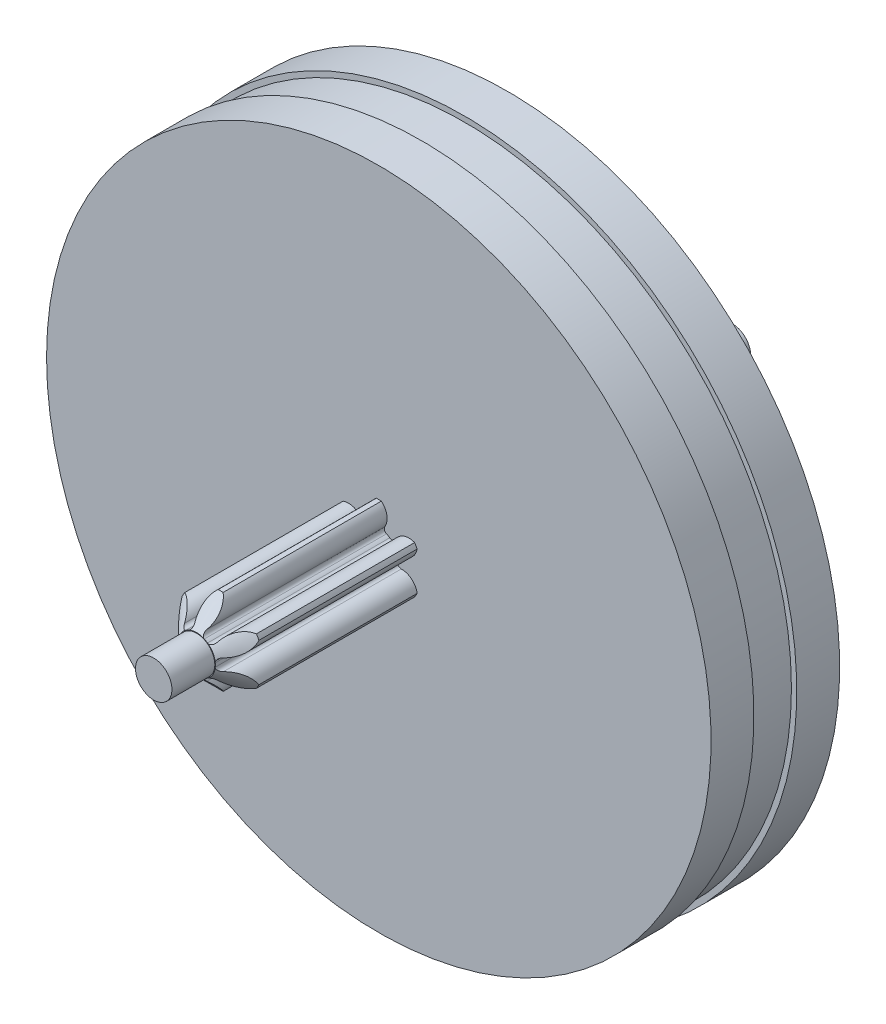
ISO-10303-21;
HEADER;
FILE_DESCRIPTION(('STEP AP214'),'2;1');
FILE_NAME('part.step','',(''),(''),'','','');
FILE_SCHEMA(('AUTOMOTIVE_DESIGN { 1 0 10303 214 1 1 1 1 }'));
ENDSEC;
DATA;
#1=APPLICATION_CONTEXT('core data for automotive mechanical design processes');
#2=APPLICATION_PROTOCOL_DEFINITION('international standard','automotive_design',2000,#1);
#3=PRODUCT_CONTEXT('',#1,'mechanical');
#4=PRODUCT('Part','Part','',(#3));
#5=PRODUCT_RELATED_PRODUCT_CATEGORY('part','',(#4));
#6=PRODUCT_DEFINITION_FORMATION('','',#4);
#7=PRODUCT_DEFINITION_CONTEXT('part definition',#1,'design');
#8=PRODUCT_DEFINITION('design','',#6,#7);
#9=PRODUCT_DEFINITION_SHAPE('','',#8);
#10=(LENGTH_UNIT() NAMED_UNIT(*) SI_UNIT(.MILLI.,.METRE.));
#11=(NAMED_UNIT(*) PLANE_ANGLE_UNIT() SI_UNIT($,.RADIAN.));
#12=(NAMED_UNIT(*) SI_UNIT($,.STERADIAN.) SOLID_ANGLE_UNIT());
#13=UNCERTAINTY_MEASURE_WITH_UNIT(LENGTH_MEASURE(1.E-05),#10,'distance_accuracy_value','');
#14=(GEOMETRIC_REPRESENTATION_CONTEXT(3) GLOBAL_UNCERTAINTY_ASSIGNED_CONTEXT((#13)) GLOBAL_UNIT_ASSIGNED_CONTEXT((#10,
#11,#12)) REPRESENTATION_CONTEXT('',''));
#15=CARTESIAN_POINT('',(0.,0.,0.));
#16=DIRECTION('',(0.,0.,1.));
#17=DIRECTION('',(1.,0.,0.));
#18=AXIS2_PLACEMENT_3D('',#15,#16,#17);
#19=CARTESIAN_POINT('',(-1.37870691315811,-0.560352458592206,-14.5));
#20=DIRECTION('',(0.,0.,-1.));
#21=DIRECTION('',(-1.,0.,0.));
#22=AXIS2_PLACEMENT_3D('',#19,#20,#21);
#23=PLANE('',#22);
#24=CARTESIAN_POINT('',(-1.37870691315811,-0.560352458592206,-14.5));
#25=DIRECTION('',(0.,0.,-1.));
#26=DIRECTION('',(-1.,0.,0.));
#27=AXIS2_PLACEMENT_3D('',#24,#25,#26);
#28=CIRCLE('',#27,1.9);
#29=CARTESIAN_POINT('',(-3.27870691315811,-0.560352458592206,-14.5));
#30=VERTEX_POINT('',#29);
#31=EDGE_CURVE('E1285',#30,#30,#28,.T.);
#32=ORIENTED_EDGE('',*,*,#31,.T.);
#33=EDGE_LOOP('',(#32));
#34=FACE_BOUND('',#33,.T.);
#35=CARTESIAN_POINT('',(-1.37870691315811,-0.560352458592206,-14.5));
#36=DIRECTION('',(0.,0.,-1.));
#37=DIRECTION('',(-1.,0.,0.));
#38=AXIS2_PLACEMENT_3D('',#35,#36,#37);
#39=CIRCLE('',#38,0.85);
#40=CARTESIAN_POINT('',(-0.528706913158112,-0.560352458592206,-14.5));
#41=VERTEX_POINT('',#40);
#42=EDGE_CURVE('E1279',#41,#41,#39,.F.);
#43=ORIENTED_EDGE('',*,*,#42,.T.);
#44=EDGE_LOOP('',(#43));
#45=FACE_BOUND('',#44,.T.);
#46=ADVANCED_FACE('F26',(#34,#45),#23,.T.);
#47=CARTESIAN_POINT('',(-1.37870691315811,-0.560352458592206,-6.));
#48=DIRECTION('',(0.,0.,-1.));
#49=DIRECTION('',(-1.,0.,0.));
#50=AXIS2_PLACEMENT_3D('',#47,#48,#49);
#51=PLANE('',#50);
#52=CARTESIAN_POINT('',(-1.37870691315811,-0.560352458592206,-6.));
#53=DIRECTION('',(0.,0.,-1.));
#54=DIRECTION('',(-1.,0.,0.));
#55=AXIS2_PLACEMENT_3D('',#52,#53,#54);
#56=CIRCLE('',#55,15.5);
#57=CARTESIAN_POINT('',(-16.8787069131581,-0.560352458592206,-6.));
#58=VERTEX_POINT('',#57);
#59=EDGE_CURVE('E1290',#58,#58,#56,.T.);
#60=ORIENTED_EDGE('',*,*,#59,.T.);
#61=EDGE_LOOP('',(#60));
#62=FACE_BOUND('',#61,.T.);
#63=CARTESIAN_POINT('',(-1.37870691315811,-0.560352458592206,-6.));
#64=DIRECTION('',(0.,0.,-1.));
#65=DIRECTION('',(-1.,0.,0.));
#66=AXIS2_PLACEMENT_3D('',#63,#64,#65);
#67=CIRCLE('',#66,1.9);
#68=CARTESIAN_POINT('',(-3.27870691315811,-0.560352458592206,-6.));
#69=VERTEX_POINT('',#68);
#70=EDGE_CURVE('E1282',#69,#69,#67,.T.);
#71=ORIENTED_EDGE('',*,*,#70,.F.);
#72=EDGE_LOOP('',(#71));
#73=FACE_BOUND('',#72,.T.);
#74=ADVANCED_FACE('F769',(#62,#73),#51,.T.);
#75=CARTESIAN_POINT('',(-1.37870691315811,-0.560352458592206,-2.));
#76=DIRECTION('',(0.,0.,-1.));
#77=DIRECTION('',(-1.,0.,0.));
#78=AXIS2_PLACEMENT_3D('',#75,#76,#77);
#79=PLANE('',#78);
#80=CARTESIAN_POINT('',(-1.37870691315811,-0.560352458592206,-2.));
#81=DIRECTION('',(0.,0.,-1.));
#82=DIRECTION('',(-1.,0.,0.));
#83=AXIS2_PLACEMENT_3D('',#80,#81,#82);
#84=CIRCLE('',#83,15.5);
#85=CARTESIAN_POINT('',(-16.8787069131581,-0.560352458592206,-2.));
#86=VERTEX_POINT('',#85);
#87=EDGE_CURVE('E1302',#86,#86,#84,.T.);
#88=ORIENTED_EDGE('',*,*,#87,.T.);
#89=EDGE_LOOP('',(#88));
#90=FACE_BOUND('',#89,.T.);
#91=CARTESIAN_POINT('',(-1.37870691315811,-0.560352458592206,-2.));
#92=DIRECTION('',(0.,0.,-1.));
#93=DIRECTION('',(-1.,0.,0.));
#94=AXIS2_PLACEMENT_3D('',#91,#92,#93);
#95=CIRCLE('',#94,15.25);
#96=CARTESIAN_POINT('',(-16.6287069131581,-0.560352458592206,-2.));
#97=VERTEX_POINT('',#96);
#98=EDGE_CURVE('E1293',#97,#97,#95,.T.);
#99=ORIENTED_EDGE('',*,*,#98,.F.);
#100=EDGE_LOOP('',(#99));
#101=FACE_BOUND('',#100,.T.);
#102=ADVANCED_FACE('F765',(#90,#101),#79,.T.);
#103=CARTESIAN_POINT('',(-1.37870691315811,-0.560352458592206,8.5));
#104=DIRECTION('',(0.,0.,-1.));
#105=DIRECTION('',(-1.,0.,0.));
#106=AXIS2_PLACEMENT_3D('',#103,#104,#105);
#107=CYLINDRICAL_SURFACE('',#106,0.875);
#108=CARTESIAN_POINT('',(-1.37870691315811,-0.560352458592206,8.5));
#109=DIRECTION('',(0.,0.,1.));
#110=DIRECTION('',(1.,0.,0.));
#111=AXIS2_PLACEMENT_3D('',#108,#109,#110);
#112=CIRCLE('',#111,0.875);
#113=CARTESIAN_POINT('',(-0.868234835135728,0.150311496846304,8.5));
#114=VERTEX_POINT('',#113);
#115=CARTESIAN_POINT('',(-1.01848991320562,0.237061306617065,8.5));
#116=VERTEX_POINT('',#115);
#117=EDGE_CURVE('E595',#114,#116,#112,.T.);
#118=ORIENTED_EDGE('',*,*,#117,.F.);
#119=DIRECTION('',(0.,0.,-1.));
#120=VECTOR('',#119,1.);
#121=CARTESIAN_POINT('',(-0.868234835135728,0.150311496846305,8.5));
#122=LINE('',#121,#120);
#123=CARTESIAN_POINT('',(-0.868234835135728,0.150311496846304,0.));
#124=VERTEX_POINT('',#123);
#125=EDGE_CURVE('E667',#114,#124,#122,.T.);
#126=ORIENTED_EDGE('',*,*,#125,.T.);
#127=CARTESIAN_POINT('',(-1.37870691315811,-0.560352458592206,0.));
#128=DIRECTION('',(0.,0.,1.));
#129=DIRECTION('',(1.,0.,0.));
#130=AXIS2_PLACEMENT_3D('',#127,#128,#129);
#131=CIRCLE('',#130,0.875);
#132=CARTESIAN_POINT('',(-1.01848991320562,0.237061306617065,0.));
#133=VERTEX_POINT('',#132);
#134=EDGE_CURVE('E725',#124,#133,#131,.T.);
#135=ORIENTED_EDGE('',*,*,#134,.T.);
#136=DIRECTION('',(0.,0.,-1.));
#137=VECTOR('',#136,1.);
#138=CARTESIAN_POINT('',(-1.01848991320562,0.237061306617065,8.5));
#139=LINE('',#138,#137);
#140=EDGE_CURVE('E605',#133,#116,#139,.F.);
#141=ORIENTED_EDGE('',*,*,#140,.T.);
#142=EDGE_LOOP('',(#118,#126,#135,#141));
#143=FACE_BOUND('',#142,.T.);
#144=ADVANCED_FACE('F28',(#143),#107,.T.);
#145=CARTESIAN_POINT('',(-1.72346861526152,0.866928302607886,8.5));
#146=DIRECTION('',(0.,0.,-1.));
#147=DIRECTION('',(-1.,0.,0.));
#148=AXIS2_PLACEMENT_3D('',#145,#146,#147);
#149=CYLINDRICAL_SURFACE('',#148,0.73330869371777);
#150=DIRECTION('',(0.,0.,-1.));
#151=VECTOR('',#150,1.);
#152=CARTESIAN_POINT('',(-1.26121452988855,1.43619344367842,8.5));
#153=LINE('',#152,#151);
#154=CARTESIAN_POINT('',(-1.26121452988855,1.43619344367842,7.38));
#155=VERTEX_POINT('',#154);
#156=CARTESIAN_POINT('',(-1.26121452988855,1.43619344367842,0.));
#157=VERTEX_POINT('',#156);
#158=EDGE_CURVE('E597',#155,#157,#153,.T.);
#159=ORIENTED_EDGE('',*,*,#158,.F.);
#160=CARTESIAN_POINT('',(-1.26121452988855,1.43619344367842,7.38));
#161=CARTESIAN_POINT('',(-1.21890454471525,1.40180327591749,7.41180482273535));
#162=CARTESIAN_POINT('',(-1.18178991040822,1.36389337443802,7.44604295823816));
#163=CARTESIAN_POINT('',(-1.11794586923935,1.28368942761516,7.51797731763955));
#164=CARTESIAN_POINT('',(-1.0911290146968,1.24143634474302,7.55564090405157));
#165=CARTESIAN_POINT('',(-1.04463922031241,1.1495612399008,7.63806019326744));
#166=CARTESIAN_POINT('',(-1.02613176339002,1.09964871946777,7.68313463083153));
#167=CARTESIAN_POINT('',(-1.00025435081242,0.998901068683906,7.77565311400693));
#168=CARTESIAN_POINT('',(-0.99292178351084,0.948063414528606,7.82310456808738));
#169=CARTESIAN_POINT('',(-0.988663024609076,0.846696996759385,7.91996839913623));
#170=CARTESIAN_POINT('',(-0.991866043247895,0.796179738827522,7.96939772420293));
#171=CARTESIAN_POINT('',(-1.00825654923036,0.697481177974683,8.06876489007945));
#172=CARTESIAN_POINT('',(-1.02142547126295,0.649295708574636,8.11870161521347));
#173=CARTESIAN_POINT('',(-1.04708210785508,0.582852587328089,8.1896670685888));
#174=CARTESIAN_POINT('',(-1.055654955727,0.563234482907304,8.21090080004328));
#175=CARTESIAN_POINT('',(-1.07457078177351,0.524682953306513,8.2531511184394));
#176=CARTESIAN_POINT('',(-1.08491174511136,0.505748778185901,8.27416792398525));
#177=CARTESIAN_POINT('',(-1.09615208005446,0.487171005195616,8.29503795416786));
#178=B_SPLINE_CURVE_WITH_KNOTS('',3,(#160,#161,#162,#163,#164,#165,#166,#167,#168,#169,#170,
#171,#172,#173,#174,#175,#176,#177),.UNSPECIFIED.,.F.,.F.,(4,2,2,2,2,2,2,2,4),(0.,
0.188522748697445,0.375407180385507,0.583632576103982,0.792553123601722,1.00404541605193,
1.2151446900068,1.30555600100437,1.39586496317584),.UNSPECIFIED.);
#179=CARTESIAN_POINT('',(-1.09615208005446,0.487171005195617,8.29503795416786));
#180=VERTEX_POINT('',#179);
#181=EDGE_CURVE('E659',#155,#180,#178,.T.);
#182=ORIENTED_EDGE('',*,*,#181,.T.);
#183=DIRECTION('',(0.,0.,-1.));
#184=VECTOR('',#183,1.);
#185=CARTESIAN_POINT('',(-1.09615208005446,0.487171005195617,8.5));
#186=LINE('',#185,#184);
#187=CARTESIAN_POINT('',(-1.09615208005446,0.487171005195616,0.));
#188=VERTEX_POINT('',#187);
#189=EDGE_CURVE('E603',#180,#188,#186,.T.);
#190=ORIENTED_EDGE('',*,*,#189,.T.);
#191=CARTESIAN_POINT('',(-1.72346861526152,0.866928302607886,0.));
#192=DIRECTION('',(0.,0.,-1.));
#193=DIRECTION('',(-1.,0.,0.));
#194=AXIS2_PLACEMENT_3D('',#191,#192,#193);
#195=CIRCLE('',#194,0.73330869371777);
#196=EDGE_CURVE('E727',#157,#188,#195,.T.);
#197=ORIENTED_EDGE('',*,*,#196,.F.);
#198=EDGE_LOOP('',(#159,#182,#190,#197));
#199=FACE_BOUND('',#198,.T.);
#200=ADVANCED_FACE('F758',(#199),#149,.T.);
#201=CARTESIAN_POINT('',(-1.37870691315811,-0.560352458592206,8.5));
#202=DIRECTION('',(0.,0.,-1.));
#203=DIRECTION('',(-1.,0.,0.));
#204=AXIS2_PLACEMENT_3D('',#201,#202,#203);
#205=CYLINDRICAL_SURFACE('',#204,2.);
#206=DIRECTION('',(0.,0.,-1.));
#207=VECTOR('',#206,1.);
#208=CARTESIAN_POINT('',(-1.49619929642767,1.43619344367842,8.5));
#209=LINE('',#208,#207);
#210=CARTESIAN_POINT('',(-1.49619929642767,1.43619344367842,7.38));
#211=VERTEX_POINT('',#210);
#212=CARTESIAN_POINT('',(-1.49619929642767,1.43619344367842,0.));
#213=VERTEX_POINT('',#212);
#214=EDGE_CURVE('E594',#211,#213,#209,.T.);
#215=ORIENTED_EDGE('',*,*,#214,.F.);
#216=CARTESIAN_POINT('',(-1.37870691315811,-0.560352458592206,7.38));
#217=DIRECTION('',(0.,0.,1.));
#218=DIRECTION('',(1.,0.,0.));
#219=AXIS2_PLACEMENT_3D('',#216,#217,#218);
#220=CIRCLE('',#219,2.);
#221=EDGE_CURVE('E751',#211,#155,#220,.F.);
#222=ORIENTED_EDGE('',*,*,#221,.T.);
#223=ORIENTED_EDGE('',*,*,#158,.T.);
#224=CARTESIAN_POINT('',(-1.37870691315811,-0.560352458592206,0.));
#225=DIRECTION('',(0.,0.,1.));
#226=DIRECTION('',(1.,0.,0.));
#227=AXIS2_PLACEMENT_3D('',#224,#225,#226);
#228=CIRCLE('',#227,2.);
#229=EDGE_CURVE('E730',#157,#213,#228,.T.);
#230=ORIENTED_EDGE('',*,*,#229,.T.);
#231=EDGE_LOOP('',(#215,#222,#223,#230));
#232=FACE_BOUND('',#231,.T.);
#233=ADVANCED_FACE('F755',(#232),#205,.T.);
#234=CARTESIAN_POINT('',(-1.0339452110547,0.866928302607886,8.5));
#235=DIRECTION('',(0.,0.,-1.));
#236=DIRECTION('',(-1.,0.,0.));
#237=AXIS2_PLACEMENT_3D('',#234,#235,#236);
#238=CYLINDRICAL_SURFACE('',#237,0.73330869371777);
#239=DIRECTION('',(0.,0.,-1.));
#240=VECTOR('',#239,1.);
#241=CARTESIAN_POINT('',(-1.66126174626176,0.487171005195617,8.5));
#242=LINE('',#241,#240);
#243=CARTESIAN_POINT('',(-1.66126174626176,0.487171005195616,0.));
#244=VERTEX_POINT('',#243);
#245=CARTESIAN_POINT('',(-1.66126174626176,0.487171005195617,8.29503795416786));
#246=VERTEX_POINT('',#245);
#247=EDGE_CURVE('E610',#244,#246,#242,.F.);
#248=ORIENTED_EDGE('',*,*,#247,.T.);
#249=CARTESIAN_POINT('',(-1.66126174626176,0.487171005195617,8.29503795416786));
#250=CARTESIAN_POINT('',(-1.67633012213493,0.512088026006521,8.26703387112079));
#251=CARTESIAN_POINT('',(-1.68979942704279,0.5376619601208,8.23876841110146));
#252=CARTESIAN_POINT('',(-1.71354788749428,0.589959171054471,8.18195817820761));
#253=CARTESIAN_POINT('',(-1.72382692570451,0.616682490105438,8.15341339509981));
#254=CARTESIAN_POINT('',(-1.74125724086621,0.671286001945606,8.09610757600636));
#255=CARTESIAN_POINT('',(-1.74838811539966,0.699172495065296,8.06734632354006));
#256=CARTESIAN_POINT('',(-1.7593464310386,0.755729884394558,8.00998073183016));
#257=CARTESIAN_POINT('',(-1.76317386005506,0.784400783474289,7.98137639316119));
#258=CARTESIAN_POINT('',(-1.76954591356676,0.871408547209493,7.89590176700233));
#259=CARTESIAN_POINT('',(-1.76695120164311,0.930650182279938,7.83946428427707));
#260=CARTESIAN_POINT('',(-1.74681827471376,1.04897130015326,7.7292824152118));
#261=CARTESIAN_POINT('',(-1.72931652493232,1.10805082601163,7.67553179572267));
#262=CARTESIAN_POINT('',(-1.68574750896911,1.20583292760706,7.587499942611));
#263=CARTESIAN_POINT('',(-1.66373699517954,1.24540006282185,7.55215732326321));
#264=CARTESIAN_POINT('',(-1.61140449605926,1.32122991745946,7.48433887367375));
#265=CARTESIAN_POINT('',(-1.58111191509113,1.35750373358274,7.45185342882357));
#266=CARTESIAN_POINT('',(-1.53074128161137,1.40677567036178,7.40707965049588));
#267=CARTESIAN_POINT('',(-1.51391184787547,1.42181373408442,7.393312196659));
#268=CARTESIAN_POINT('',(-1.49619929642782,1.4361934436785,7.37999999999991));
#269=B_SPLINE_CURVE_WITH_KNOTS('',3,(#249,#250,#251,#252,#253,#254,#255,#256,#257,#258,#259,
#260,#261,#262,#263,#264,#265,#266,#267,#268),.UNSPECIFIED.,.F.,.F.,(4,2,2,2,2,2,2,2,2,4),(0.,
0.121146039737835,0.242296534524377,0.364221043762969,0.48614599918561,0.730392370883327,
0.974042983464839,1.14572853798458,1.31681228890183,1.3960364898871),.UNSPECIFIED.);
#270=EDGE_CURVE('E631',#246,#211,#269,.T.);
#271=ORIENTED_EDGE('',*,*,#270,.T.);
#272=ORIENTED_EDGE('',*,*,#214,.T.);
#273=CARTESIAN_POINT('',(-1.0339452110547,0.866928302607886,0.));
#274=DIRECTION('',(0.,0.,1.));
#275=DIRECTION('',(1.,0.,0.));
#276=AXIS2_PLACEMENT_3D('',#273,#274,#275);
#277=CIRCLE('',#276,0.73330869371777);
#278=EDGE_CURVE('E733',#213,#244,#277,.T.);
#279=ORIENTED_EDGE('',*,*,#278,.T.);
#280=EDGE_LOOP('',(#248,#271,#272,#279));
#281=FACE_BOUND('',#280,.T.);
#282=ADVANCED_FACE('F737',(#281),#238,.T.);
#283=CARTESIAN_POINT('',(-1.37870691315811,-0.560352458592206,8.5));
#284=DIRECTION('',(0.,0.,-1.));
#285=DIRECTION('',(-1.,0.,0.));
#286=AXIS2_PLACEMENT_3D('',#283,#284,#285);
#287=CYLINDRICAL_SURFACE('',#286,0.875);
#288=CARTESIAN_POINT('',(-1.37870691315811,-0.560352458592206,0.));
#289=DIRECTION('',(0.,0.,-1.));
#290=DIRECTION('',(-1.,0.,0.));
#291=AXIS2_PLACEMENT_3D('',#288,#289,#290);
#292=CIRCLE('',#291,0.875);
#293=CARTESIAN_POINT('',(-1.88917899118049,0.150311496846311,0.));
#294=VERTEX_POINT('',#293);
#295=CARTESIAN_POINT('',(-1.7389239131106,0.237061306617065,0.));
#296=VERTEX_POINT('',#295);
#297=EDGE_CURVE('E573',#294,#296,#292,.T.);
#298=ORIENTED_EDGE('',*,*,#297,.F.);
#299=DIRECTION('',(0.,0.,-1.));
#300=VECTOR('',#299,1.);
#301=CARTESIAN_POINT('',(-1.88917899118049,0.150311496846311,8.5));
#302=LINE('',#301,#300);
#303=CARTESIAN_POINT('',(-1.88917899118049,0.150311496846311,8.5));
#304=VERTEX_POINT('',#303);
#305=EDGE_CURVE('E566',#294,#304,#302,.F.);
#306=ORIENTED_EDGE('',*,*,#305,.T.);
#307=CARTESIAN_POINT('',(-1.37870691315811,-0.560352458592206,8.5));
#308=DIRECTION('',(0.,0.,-1.));
#309=DIRECTION('',(-1.,0.,0.));
#310=AXIS2_PLACEMENT_3D('',#307,#308,#309);
#311=CIRCLE('',#310,0.875);
#312=CARTESIAN_POINT('',(-1.7389239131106,0.237061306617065,8.5));
#313=VERTEX_POINT('',#312);
#314=EDGE_CURVE('E585',#304,#313,#311,.T.);
#315=ORIENTED_EDGE('',*,*,#314,.T.);
#316=DIRECTION('',(0.,0.,-1.));
#317=VECTOR('',#316,1.);
#318=CARTESIAN_POINT('',(-1.7389239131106,0.237061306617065,8.5));
#319=LINE('',#318,#317);
#320=EDGE_CURVE('E608',#313,#296,#319,.T.);
#321=ORIENTED_EDGE('',*,*,#320,.T.);
#322=EDGE_LOOP('',(#298,#306,#315,#321));
#323=FACE_BOUND('',#322,.T.);
#324=ADVANCED_FACE('F583',(#323),#287,.T.);
#325=CARTESIAN_POINT('',(-1.37870691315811,-0.560352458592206,8.5));
#326=DIRECTION('',(0.,0.,1.));
#327=DIRECTION('',(1.,0.,0.));
#328=AXIS2_PLACEMENT_3D('',#325,#326,#327);
#329=PLANE('',#328);
#330=CARTESIAN_POINT('',(-1.37870691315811,-0.560352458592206,8.5));
#331=DIRECTION('',(0.,0.,1.));
#332=DIRECTION('',(1.,0.,0.));
#333=AXIS2_PLACEMENT_3D('',#330,#331,#332);
#334=CIRCLE('',#333,0.85);
#335=CARTESIAN_POINT('',(-0.528706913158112,-0.560352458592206,8.5));
#336=VERTEX_POINT('',#335);
#337=EDGE_CURVE('E11',#336,#336,#334,.T.);
#338=ORIENTED_EDGE('',*,*,#337,.F.);
#339=EDGE_LOOP('',(#338));
#340=FACE_BOUND('',#339,.T.);
#341=CARTESIAN_POINT('',(-1.99127340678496,0.292444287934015,8.5));
#342=DIRECTION('',(0.,0.,1.));
#343=DIRECTION('',(1.,0.,0.));
#344=AXIS2_PLACEMENT_3D('',#341,#342,#343);
#345=CIRCLE('',#344,0.175);
#346=CARTESIAN_POINT('',(-1.92249098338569,0.131528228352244,8.5));
#347=VERTEX_POINT('',#346);
#348=EDGE_CURVE('E324',#304,#347,#345,.F.);
#349=ORIENTED_EDGE('',*,*,#348,.T.);
#350=CARTESIAN_POINT('',(-1.37870691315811,-0.560352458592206,8.5));
#351=DIRECTION('',(0.,0.,1.));
#352=DIRECTION('',(1.,0.,0.));
#353=AXIS2_PLACEMENT_3D('',#350,#351,#352);
#354=CIRCLE('',#353,0.88);
#355=CARTESIAN_POINT('',(-2.24978519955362,-0.435361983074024,8.5));
#356=VERTEX_POINT('',#355);
#357=EDGE_CURVE('E900',#347,#356,#354,.T.);
#358=ORIENTED_EDGE('',*,*,#357,.T.);
#359=CARTESIAN_POINT('',(-2.42353380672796,-0.456252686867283,8.5));
#360=DIRECTION('',(0.,0.,1.));
#361=DIRECTION('',(1.,0.,0.));
#362=AXIS2_PLACEMENT_3D('',#359,#360,#361);
#363=CIRCLE('',#362,0.175);
#364=CARTESIAN_POINT('',(-2.24939599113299,-0.473602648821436,8.5));
#365=VERTEX_POINT('',#364);
#366=EDGE_CURVE('E323',#356,#365,#363,.F.);
#367=ORIENTED_EDGE('',*,*,#366,.T.);
#368=CARTESIAN_POINT('',(-1.37870691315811,-0.560352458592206,8.5));
#369=DIRECTION('',(0.,0.,1.));
#370=DIRECTION('',(-0.499999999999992,0.866025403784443,0.));
#371=AXIS2_PLACEMENT_3D('',#368,#369,#370);
#372=CIRCLE('',#371,0.875);
#373=CARTESIAN_POINT('',(-2.24939599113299,-0.647102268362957,8.5));
#374=VERTEX_POINT('',#373);
#375=EDGE_CURVE('E912',#365,#374,#372,.T.);
#376=ORIENTED_EDGE('',*,*,#375,.T.);
#377=CARTESIAN_POINT('',(-2.42353380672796,-0.664452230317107,8.5));
#378=DIRECTION('',(0.,0.,1.));
#379=DIRECTION('',(1.,0.,0.));
#380=AXIS2_PLACEMENT_3D('',#377,#378,#379);
#381=CIRCLE('',#380,0.175);
#382=CARTESIAN_POINT('',(-2.24978519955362,-0.685342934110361,8.5));
#383=VERTEX_POINT('',#382);
#384=EDGE_CURVE('E556',#374,#383,#381,.F.);
#385=ORIENTED_EDGE('',*,*,#384,.T.);
#386=CARTESIAN_POINT('',(-1.37870691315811,-0.560352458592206,8.5));
#387=DIRECTION('',(0.,0.,1.));
#388=DIRECTION('',(1.,0.,0.));
#389=AXIS2_PLACEMENT_3D('',#386,#387,#388);
#390=CIRCLE('',#389,0.879999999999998);
#391=CARTESIAN_POINT('',(-1.9224909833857,-1.25223314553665,8.5));
#392=VERTEX_POINT('',#391);
#393=EDGE_CURVE('E416',#383,#392,#390,.T.);
#394=ORIENTED_EDGE('',*,*,#393,.T.);
#395=CARTESIAN_POINT('',(-1.99127340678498,-1.41314920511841,8.5));
#396=DIRECTION('',(0.,0.,1.));
#397=DIRECTION('',(1.,0.,0.));
#398=AXIS2_PLACEMENT_3D('',#395,#396,#397);
#399=CIRCLE('',#398,0.175);
#400=CARTESIAN_POINT('',(-1.8891789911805,-1.27101641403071,8.5));
#401=VERTEX_POINT('',#400);
#402=EDGE_CURVE('E562',#392,#401,#399,.F.);
#403=ORIENTED_EDGE('',*,*,#402,.T.);
#404=CARTESIAN_POINT('',(-1.37870691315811,-0.560352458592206,8.5));
#405=DIRECTION('',(0.,0.,1.));
#406=DIRECTION('',(-1.,0.,0.));
#407=AXIS2_PLACEMENT_3D('',#404,#405,#406);
#408=CIRCLE('',#407,0.875);
#409=CARTESIAN_POINT('',(-1.73892391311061,-1.35776622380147,8.5));
#410=VERTEX_POINT('',#409);
#411=EDGE_CURVE('E922',#401,#410,#408,.T.);
#412=ORIENTED_EDGE('',*,*,#411,.T.);
#413=CARTESIAN_POINT('',(-1.81096731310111,-1.51724897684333,8.5));
#414=DIRECTION('',(0.,0.,1.));
#415=DIRECTION('',(1.,0.,0.));
#416=AXIS2_PLACEMENT_3D('',#413,#414,#415);
#417=CIRCLE('',#416,0.175);
#418=CARTESIAN_POINT('',(-1.70600112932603,-1.37722362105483,8.5));
#419=VERTEX_POINT('',#418);
#420=EDGE_CURVE('E538',#410,#419,#417,.F.);
#421=ORIENTED_EDGE('',*,*,#420,.T.);
#422=CARTESIAN_POINT('',(-1.37870691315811,-0.560352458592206,8.5));
#423=DIRECTION('',(0.,0.,1.));
#424=DIRECTION('',(1.,0.,0.));
#425=AXIS2_PLACEMENT_3D('',#422,#423,#424);
#426=CIRCLE('',#425,0.880000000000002);
#427=CARTESIAN_POINT('',(-1.05141269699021,-1.37722362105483,8.5));
#428=VERTEX_POINT('',#427);
#429=EDGE_CURVE('E493',#419,#428,#426,.T.);
#430=ORIENTED_EDGE('',*,*,#429,.T.);
#431=CARTESIAN_POINT('',(-0.946446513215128,-1.51724897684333,8.5));
#432=DIRECTION('',(0.,0.,1.));
#433=DIRECTION('',(1.,0.,0.));
#434=AXIS2_PLACEMENT_3D('',#431,#432,#433);
#435=CIRCLE('',#434,0.175);
#436=CARTESIAN_POINT('',(-1.01848991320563,-1.35776622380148,8.5));
#437=VERTEX_POINT('',#436);
#438=EDGE_CURVE('E505',#428,#437,#435,.F.);
#439=ORIENTED_EDGE('',*,*,#438,.T.);
#440=CARTESIAN_POINT('',(-1.37870691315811,-0.560352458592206,8.5));
#441=DIRECTION('',(0.,0.,1.));
#442=DIRECTION('',(-0.500000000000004,-0.866025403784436,0.));
#443=AXIS2_PLACEMENT_3D('',#440,#441,#442);
#444=CIRCLE('',#443,0.875);
#445=CARTESIAN_POINT('',(-0.868234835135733,-1.27101641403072,8.5));
#446=VERTEX_POINT('',#445);
#447=EDGE_CURVE('E936',#437,#446,#444,.T.);
#448=ORIENTED_EDGE('',*,*,#447,.T.);
#449=CARTESIAN_POINT('',(-0.766140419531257,-1.41314920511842,8.5));
#450=DIRECTION('',(0.,0.,1.));
#451=DIRECTION('',(1.,0.,0.));
#452=AXIS2_PLACEMENT_3D('',#449,#450,#451);
#453=CIRCLE('',#452,0.175);
#454=CARTESIAN_POINT('',(-0.834922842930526,-1.25223314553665,8.5));
#455=VERTEX_POINT('',#454);
#456=EDGE_CURVE('E698',#446,#455,#453,.F.);
#457=ORIENTED_EDGE('',*,*,#456,.T.);
#458=CARTESIAN_POINT('',(-1.37870691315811,-0.560352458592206,8.5));
#459=DIRECTION('',(0.,0.,1.));
#460=DIRECTION('',(1.,0.,0.));
#461=AXIS2_PLACEMENT_3D('',#458,#459,#460);
#462=CIRCLE('',#461,0.88);
#463=CARTESIAN_POINT('',(-0.507628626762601,-0.685342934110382,8.5));
#464=VERTEX_POINT('',#463);
#465=EDGE_CURVE('E374',#455,#464,#462,.T.);
#466=ORIENTED_EDGE('',*,*,#465,.T.);
#467=CARTESIAN_POINT('',(-0.333880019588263,-0.664452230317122,8.5));
#468=DIRECTION('',(0.,0.,1.));
#469=DIRECTION('',(1.,0.,0.));
#470=AXIS2_PLACEMENT_3D('',#467,#468,#469);
#471=CIRCLE('',#470,0.175);
#472=CARTESIAN_POINT('',(-0.508017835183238,-0.647102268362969,8.5));
#473=VERTEX_POINT('',#472);
#474=EDGE_CURVE('E527',#464,#473,#471,.F.);
#475=ORIENTED_EDGE('',*,*,#474,.T.);
#476=CARTESIAN_POINT('',(-1.37870691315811,-0.560352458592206,8.5));
#477=DIRECTION('',(0.,0.,1.));
#478=DIRECTION('',(0.499999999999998,-0.86602540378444,0.));
#479=AXIS2_PLACEMENT_3D('',#476,#477,#478);
#480=CIRCLE('',#479,0.875);
#481=CARTESIAN_POINT('',(-0.508017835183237,-0.473602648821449,8.5));
#482=VERTEX_POINT('',#481);
#483=EDGE_CURVE('E713',#473,#482,#480,.T.);
#484=ORIENTED_EDGE('',*,*,#483,.T.);
#485=CARTESIAN_POINT('',(-0.333880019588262,-0.456252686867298,8.5));
#486=DIRECTION('',(0.,0.,1.));
#487=DIRECTION('',(1.,0.,0.));
#488=AXIS2_PLACEMENT_3D('',#485,#486,#487);
#489=CIRCLE('',#488,0.175);
#490=CARTESIAN_POINT('',(-0.507628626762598,-0.435361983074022,8.5));
#491=VERTEX_POINT('',#490);
#492=EDGE_CURVE('E676',#482,#491,#489,.F.);
#493=ORIENTED_EDGE('',*,*,#492,.T.);
#494=CARTESIAN_POINT('',(-1.37870691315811,-0.560352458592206,8.5));
#495=DIRECTION('',(0.,0.,1.));
#496=DIRECTION('',(1.,0.,0.));
#497=AXIS2_PLACEMENT_3D('',#494,#495,#496);
#498=CIRCLE('',#497,0.880000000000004);
#499=CARTESIAN_POINT('',(-0.834922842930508,0.131528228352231,8.5));
#500=VERTEX_POINT('',#499);
#501=EDGE_CURVE('E326',#491,#500,#498,.T.);
#502=ORIENTED_EDGE('',*,*,#501,.T.);
#503=CARTESIAN_POINT('',(-0.766140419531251,0.292444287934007,8.5));
#504=DIRECTION('',(0.,0.,1.));
#505=DIRECTION('',(1.,0.,0.));
#506=AXIS2_PLACEMENT_3D('',#503,#504,#505);
#507=CIRCLE('',#506,0.175);
#508=EDGE_CURVE('E682',#500,#114,#507,.F.);
#509=ORIENTED_EDGE('',*,*,#508,.T.);
#510=ORIENTED_EDGE('',*,*,#117,.T.);
#511=CARTESIAN_POINT('',(-0.946446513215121,0.396544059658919,8.5));
#512=DIRECTION('',(0.,0.,1.));
#513=DIRECTION('',(1.,0.,0.));
#514=AXIS2_PLACEMENT_3D('',#511,#512,#513);
#515=CIRCLE('',#514,0.175);
#516=CARTESIAN_POINT('',(-1.05141269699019,0.25651870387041,8.5));
#517=VERTEX_POINT('',#516);
#518=EDGE_CURVE('E616',#116,#517,#515,.F.);
#519=ORIENTED_EDGE('',*,*,#518,.T.);
#520=CARTESIAN_POINT('',(-1.37870691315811,-0.560352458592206,8.5));
#521=DIRECTION('',(0.,0.,1.));
#522=DIRECTION('',(1.,0.,0.));
#523=AXIS2_PLACEMENT_3D('',#520,#521,#522);
#524=CIRCLE('',#523,0.88);
#525=CARTESIAN_POINT('',(-1.70600112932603,0.25651870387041,8.5));
#526=VERTEX_POINT('',#525);
#527=EDGE_CURVE('E622',#517,#526,#524,.T.);
#528=ORIENTED_EDGE('',*,*,#527,.T.);
#529=CARTESIAN_POINT('',(-1.8109673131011,0.396544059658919,8.5));
#530=DIRECTION('',(0.,0.,1.));
#531=DIRECTION('',(1.,0.,0.));
#532=AXIS2_PLACEMENT_3D('',#529,#530,#531);
#533=CIRCLE('',#532,0.175);
#534=EDGE_CURVE('E592',#526,#313,#533,.F.);
#535=ORIENTED_EDGE('',*,*,#534,.T.);
#536=ORIENTED_EDGE('',*,*,#314,.F.);
#537=EDGE_LOOP('',(#349,#358,#367,#376,#385,#394,#403,#412,#421,#430,#439,#448,#457,#466,#475,
#484,#493,#502,#509,#510,#519,#528,#535,#536));
#538=FACE_BOUND('',#537,.T.);
#539=ADVANCED_FACE('F587',(#340,#538),#329,.T.);
#540=CARTESIAN_POINT('',(-0.946446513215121,0.396544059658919,8.5));
#541=DIRECTION('',(0.,0.,1.));
#542=DIRECTION('',(1.,0.,0.));
#543=AXIS2_PLACEMENT_3D('',#540,#541,#542);
#544=CYLINDRICAL_SURFACE('',#543,0.175);
#545=ORIENTED_EDGE('',*,*,#189,.F.);
#546=CARTESIAN_POINT('',(-1.09615208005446,0.487171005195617,8.29503795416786));
#547=CARTESIAN_POINT('',(-1.10331210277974,0.475284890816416,8.30836325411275));
#548=CARTESIAN_POINT('',(-1.10899366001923,0.46277054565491,8.32191944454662));
#549=CARTESIAN_POINT('',(-1.11735055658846,0.436667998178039,8.34929758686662));
#550=CARTESIAN_POINT('',(-1.11998389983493,0.423067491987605,8.36312064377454));
#551=CARTESIAN_POINT('',(-1.12199467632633,0.395304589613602,8.39046636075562));
#552=CARTESIAN_POINT('',(-1.12136882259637,0.381141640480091,8.40398870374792));
#553=CARTESIAN_POINT('',(-1.11646260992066,0.352637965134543,8.43011443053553));
#554=CARTESIAN_POINT('',(-1.1122019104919,0.338298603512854,8.44272236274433));
#555=CARTESIAN_POINT('',(-1.1026176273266,0.3172142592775,8.46004107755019));
#556=CARTESIAN_POINT('',(-1.09894473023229,0.310326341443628,8.46549970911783));
#557=CARTESIAN_POINT('',(-1.09044654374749,0.296781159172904,8.47571350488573));
#558=CARTESIAN_POINT('',(-1.08562673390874,0.290122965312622,8.48047184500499));
#559=CARTESIAN_POINT('',(-1.07611044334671,0.278850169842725,8.48792580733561));
#560=CARTESIAN_POINT('',(-1.07169330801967,0.274145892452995,8.49083841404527));
#561=CARTESIAN_POINT('',(-1.06211267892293,0.26505061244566,8.49598379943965));
#562=CARTESIAN_POINT('',(-1.05694312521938,0.260662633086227,8.498210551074));
#563=CARTESIAN_POINT('',(-1.05141269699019,0.25651870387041,8.5));
#564=B_SPLINE_CURVE_WITH_KNOTS('',3,(#546,#547,#548,#549,#550,#551,#552,#553,#554,#555,#556,
#557,#558,#559,#560,#561,#562,#563),.UNSPECIFIED.,.F.,.F.,(4,2,2,2,2,2,2,2,4),(0.,
0.0576473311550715,0.116079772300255,0.174571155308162,0.232748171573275,0.261250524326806,
0.289619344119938,0.310785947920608,0.332133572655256),.UNSPECIFIED.);
#565=EDGE_CURVE('E652',#180,#517,#564,.T.);
#566=ORIENTED_EDGE('',*,*,#565,.T.);
#567=ORIENTED_EDGE('',*,*,#518,.F.);
#568=ORIENTED_EDGE('',*,*,#140,.F.);
#569=CARTESIAN_POINT('',(-0.946446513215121,0.396544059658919,0.));
#570=DIRECTION('',(0.,0.,1.));
#571=DIRECTION('',(1.,0.,0.));
#572=AXIS2_PLACEMENT_3D('',#569,#570,#571);
#573=CIRCLE('',#572,0.175);
#574=EDGE_CURVE('E613',#188,#133,#573,.T.);
#575=ORIENTED_EDGE('',*,*,#574,.F.);
#576=EDGE_LOOP('',(#545,#566,#567,#568,#575));
#577=FACE_BOUND('',#576,.T.);
#578=ADVANCED_FACE('F644',(#577),#544,.F.);
#579=CARTESIAN_POINT('',(-1.8109673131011,0.396544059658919,8.5));
#580=DIRECTION('',(0.,0.,1.));
#581=DIRECTION('',(1.,0.,0.));
#582=AXIS2_PLACEMENT_3D('',#579,#580,#581);
#583=CYLINDRICAL_SURFACE('',#582,0.175);
#584=ORIENTED_EDGE('',*,*,#534,.F.);
#585=CARTESIAN_POINT('',(-1.70600112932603,0.25651870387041,8.5));
#586=CARTESIAN_POINT('',(-1.69873808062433,0.261962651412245,8.4976474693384));
#587=CARTESIAN_POINT('',(-1.69211418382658,0.267809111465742,8.4945533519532));
#588=CARTESIAN_POINT('',(-1.68018061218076,0.279962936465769,8.48727511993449));
#589=CARTESIAN_POINT('',(-1.6748543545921,0.286262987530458,8.48310633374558));
#590=CARTESIAN_POINT('',(-1.66400253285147,0.300979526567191,8.47268839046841));
#591=CARTESIAN_POINT('',(-1.65885407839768,0.309486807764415,8.46618507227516));
#592=CARTESIAN_POINT('',(-1.65020821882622,0.326722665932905,8.45233068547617));
#593=CARTESIAN_POINT('',(-1.64672210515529,0.335452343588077,8.44497422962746));
#594=CARTESIAN_POINT('',(-1.64006629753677,0.356677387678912,8.42648095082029));
#595=CARTESIAN_POINT('',(-1.63767380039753,0.369181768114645,8.41507613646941));
#596=CARTESIAN_POINT('',(-1.63554790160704,0.393918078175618,8.39177815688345));
#597=CARTESIAN_POINT('',(-1.63581437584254,0.406150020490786,8.37988501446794));
#598=CARTESIAN_POINT('',(-1.63882134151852,0.430337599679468,8.35573333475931));
#599=CARTESIAN_POINT('',(-1.64160235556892,0.442285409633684,8.34347200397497));
#600=CARTESIAN_POINT('',(-1.64961771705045,0.465379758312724,8.31909283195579));
#601=CARTESIAN_POINT('',(-1.65484253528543,0.47652921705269,8.30697461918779));
#602=CARTESIAN_POINT('',(-1.66126174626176,0.487171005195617,8.29503795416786));
#603=B_SPLINE_CURVE_WITH_KNOTS('',3,(#585,#586,#587,#588,#589,#590,#591,#592,#593,#594,#595,
#596,#597,#598,#599,#600,#601,#602),.UNSPECIFIED.,.F.,.F.,(4,2,2,2,2,2,2,2,4),(0.,
0.0279616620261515,0.0555446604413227,0.0910013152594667,0.126695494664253,0.177701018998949,
0.228704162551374,0.280544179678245,0.332183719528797),.UNSPECIFIED.);
#604=EDGE_CURVE('E624',#526,#246,#603,.T.);
#605=ORIENTED_EDGE('',*,*,#604,.T.);
#606=ORIENTED_EDGE('',*,*,#247,.F.);
#607=CARTESIAN_POINT('',(-1.8109673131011,0.396544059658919,0.));
#608=DIRECTION('',(0.,0.,1.));
#609=DIRECTION('',(1.,0.,0.));
#610=AXIS2_PLACEMENT_3D('',#607,#608,#609);
#611=CIRCLE('',#610,0.175);
#612=EDGE_CURVE('E619',#296,#244,#611,.T.);
#613=ORIENTED_EDGE('',*,*,#612,.F.);
#614=ORIENTED_EDGE('',*,*,#320,.F.);
#615=EDGE_LOOP('',(#584,#605,#606,#613,#614));
#616=FACE_BOUND('',#615,.T.);
#617=ADVANCED_FACE('F640',(#616),#583,.F.);
#618=CARTESIAN_POINT('',(-1.37870691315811,-0.560352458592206,8.5));
#619=DIRECTION('',(0.,0.,-1.));
#620=DIRECTION('',(-1.,0.,0.));
#621=AXIS2_PLACEMENT_3D('',#618,#619,#620);
#622=CONICAL_SURFACE('',#621,0.88,0.785398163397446);
#623=ORIENTED_EDGE('',*,*,#181,.F.);
#624=ORIENTED_EDGE('',*,*,#221,.F.);
#625=ORIENTED_EDGE('',*,*,#270,.F.);
#626=ORIENTED_EDGE('',*,*,#604,.F.);
#627=ORIENTED_EDGE('',*,*,#527,.F.);
#628=ORIENTED_EDGE('',*,*,#565,.F.);
#629=EDGE_LOOP('',(#623,#624,#625,#626,#627,#628));
#630=FACE_BOUND('',#629,.T.);
#631=ADVANCED_FACE('F637',(#630),#622,.T.);
#632=CARTESIAN_POINT('',(-1.37870691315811,-0.560352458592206,8.5));
#633=DIRECTION('',(0.,0.,-1.));
#634=DIRECTION('',(-1.,0.,0.));
#635=AXIS2_PLACEMENT_3D('',#632,#633,#634);
#636=CYLINDRICAL_SURFACE('',#635,0.875);
#637=ORIENTED_EDGE('',*,*,#483,.F.);
#638=DIRECTION('',(0.,0.,-1.));
#639=VECTOR('',#638,1.);
#640=CARTESIAN_POINT('',(-0.508017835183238,-0.647102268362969,8.5));
#641=LINE('',#640,#639);
#642=CARTESIAN_POINT('',(-0.508017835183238,-0.647102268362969,0.));
#643=VERTEX_POINT('',#642);
#644=EDGE_CURVE('E689',#473,#643,#641,.T.);
#645=ORIENTED_EDGE('',*,*,#644,.T.);
#646=CARTESIAN_POINT('',(-1.37870691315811,-0.560352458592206,0.));
#647=DIRECTION('',(0.,0.,1.));
#648=DIRECTION('',(0.499999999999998,-0.86602540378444,0.));
#649=AXIS2_PLACEMENT_3D('',#646,#647,#648);
#650=CIRCLE('',#649,0.875);
#651=CARTESIAN_POINT('',(-0.508017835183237,-0.473602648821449,0.));
#652=VERTEX_POINT('',#651);
#653=EDGE_CURVE('E705',#643,#652,#650,.T.);
#654=ORIENTED_EDGE('',*,*,#653,.T.);
#655=DIRECTION('',(0.,0.,-1.));
#656=VECTOR('',#655,1.);
#657=CARTESIAN_POINT('',(-0.508017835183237,-0.473602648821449,8.5));
#658=LINE('',#657,#656);
#659=EDGE_CURVE('E664',#652,#482,#658,.F.);
#660=ORIENTED_EDGE('',*,*,#659,.T.);
#661=EDGE_LOOP('',(#637,#645,#654,#660));
#662=FACE_BOUND('',#661,.T.);
#663=ADVANCED_FACE('F711',(#662),#636,.T.);
#664=CARTESIAN_POINT('',(-0.315026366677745,0.451860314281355,8.5));
#665=DIRECTION('',(0.,0.,-1.));
#666=DIRECTION('',(-1.,0.,0.));
#667=AXIS2_PLACEMENT_3D('',#664,#665,#666);
#668=CYLINDRICAL_SURFACE('',#667,0.73330869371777);
#669=DIRECTION('',(0.,0.,-1.));
#670=VECTOR('',#669,1.);
#671=CARTESIAN_POINT('',(0.409098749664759,0.336169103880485,8.5));
#672=LINE('',#671,#670);
#673=CARTESIAN_POINT('',(0.409098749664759,0.336169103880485,7.38));
#674=VERTEX_POINT('',#673);
#675=CARTESIAN_POINT('',(0.409098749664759,0.336169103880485,0.));
#676=VERTEX_POINT('',#675);
#677=EDGE_CURVE('E718',#674,#676,#672,.T.);
#678=ORIENTED_EDGE('',*,*,#677,.F.);
#679=CARTESIAN_POINT('',(0.409098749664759,0.336169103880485,7.38));
#680=CARTESIAN_POINT('',(0.400470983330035,0.282332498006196,7.41180482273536));
#681=CARTESIAN_POINT('',(0.38619736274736,0.23123533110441,7.44604295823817));
#682=CARTESIAN_POINT('',(0.348660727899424,0.135842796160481,7.51797731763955));
#683=CARTESIAN_POINT('',(0.32547691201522,0.0914921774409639,7.55564090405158));
#684=CARTESIAN_POINT('',(0.269155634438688,0.00529328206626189,7.63806019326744));
#685=CARTESIAN_POINT('',(0.23518385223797,-0.0356909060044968,7.68313463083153));
#686=CARTESIAN_POINT('',(0.160872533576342,-0.108475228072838,7.77565311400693));
#687=CARTESIAN_POINT('',(0.120512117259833,-0.140244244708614,7.82310456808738));
#688=CARTESIAN_POINT('',(0.034855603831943,-0.194615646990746,7.91996839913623));
#689=CARTESIAN_POINT('',(-0.0104951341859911,-0.217100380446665,7.96939772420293));
#690=CARTESIAN_POINT('',(-0.104165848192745,-0.25225506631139,8.06876489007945));
#691=CARTESIAN_POINT('',(-0.15248014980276,-0.264943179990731,8.11870161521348));
#692=CARTESIAN_POINT('',(-0.222849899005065,-0.275945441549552,8.18966706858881));
#693=CARTESIAN_POINT('',(-0.24412609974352,-0.278330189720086,8.21090080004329));
#694=CARTESIAN_POINT('',(-0.286970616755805,-0.28122436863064,8.25315111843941));
#695=CARTESIAN_POINT('',(-0.308538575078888,-0.281735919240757,8.27416792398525));
#696=CARTESIAN_POINT('',(-0.330247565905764,-0.28129039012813,8.29503795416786));
#697=B_SPLINE_CURVE_WITH_KNOTS('',3,(#679,#680,#681,#682,#683,#684,#685,#686,#687,#688,#689,
#690,#691,#692,#693,#694,#695,#696),.UNSPECIFIED.,.F.,.F.,(4,2,2,2,2,2,2,2,4),(0.,
0.188522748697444,0.375407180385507,0.58363257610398,0.792553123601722,1.00404541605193,
1.2151446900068,1.30555600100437,1.39586496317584),.UNSPECIFIED.);
#698=CARTESIAN_POINT('',(-0.330247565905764,-0.28129039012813,8.29503795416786));
#699=VERTEX_POINT('',#698);
#700=EDGE_CURVE('E375',#674,#699,#697,.T.);
#701=ORIENTED_EDGE('',*,*,#700,.T.);
#702=DIRECTION('',(0.,0.,-1.));
#703=VECTOR('',#702,1.);
#704=CARTESIAN_POINT('',(-0.330247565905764,-0.28129039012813,8.5));
#705=LINE('',#704,#703);
#706=CARTESIAN_POINT('',(-0.330247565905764,-0.28129039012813,0.));
#707=VERTEX_POINT('',#706);
#708=EDGE_CURVE('E658',#699,#707,#705,.T.);
#709=ORIENTED_EDGE('',*,*,#708,.T.);
#710=CARTESIAN_POINT('',(-0.315026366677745,0.451860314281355,0.));
#711=DIRECTION('',(0.,0.,-1.));
#712=DIRECTION('',(-0.499999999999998,0.86602540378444,0.));
#713=AXIS2_PLACEMENT_3D('',#710,#711,#712);
#714=CIRCLE('',#713,0.73330869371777);
#715=EDGE_CURVE('E943',#676,#707,#714,.T.);
#716=ORIENTED_EDGE('',*,*,#715,.F.);
#717=EDGE_LOOP('',(#678,#701,#709,#716));
#718=FACE_BOUND('',#717,.T.);
#719=ADVANCED_FACE('F968',(#718),#668,.T.);
#720=CARTESIAN_POINT('',(-1.37870691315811,-0.560352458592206,8.5));
#721=DIRECTION('',(0.,0.,-1.));
#722=DIRECTION('',(-1.,0.,0.));
#723=AXIS2_PLACEMENT_3D('',#720,#721,#722);
#724=CYLINDRICAL_SURFACE('',#723,2.);
#725=DIRECTION('',(0.,0.,-1.));
#726=VECTOR('',#725,1.);
#727=CARTESIAN_POINT('',(0.291606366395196,0.539671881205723,8.5));
#728=LINE('',#727,#726);
#729=CARTESIAN_POINT('',(0.291606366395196,0.539671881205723,7.38));
#730=VERTEX_POINT('',#729);
#731=CARTESIAN_POINT('',(0.291606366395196,0.539671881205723,0.));
#732=VERTEX_POINT('',#731);
#733=EDGE_CURVE('E715',#730,#732,#728,.T.);
#734=ORIENTED_EDGE('',*,*,#733,.F.);
#735=CARTESIAN_POINT('',(-1.37870691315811,-0.560352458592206,7.38));
#736=DIRECTION('',(0.,0.,1.));
#737=DIRECTION('',(1.,0.,0.));
#738=AXIS2_PLACEMENT_3D('',#735,#736,#737);
#739=CIRCLE('',#738,2.);
#740=EDGE_CURVE('E966',#730,#674,#739,.F.);
#741=ORIENTED_EDGE('',*,*,#740,.T.);
#742=ORIENTED_EDGE('',*,*,#677,.T.);
#743=CARTESIAN_POINT('',(-1.37870691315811,-0.560352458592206,0.));
#744=DIRECTION('',(0.,0.,1.));
#745=DIRECTION('',(0.499999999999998,-0.86602540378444,0.));
#746=AXIS2_PLACEMENT_3D('',#743,#744,#745);
#747=CIRCLE('',#746,2.);
#748=EDGE_CURVE('E720',#676,#732,#747,.T.);
#749=ORIENTED_EDGE('',*,*,#748,.T.);
#750=EDGE_LOOP('',(#734,#741,#742,#749));
#751=FACE_BOUND('',#750,.T.);
#752=ADVANCED_FACE('F950',(#751),#724,.T.);
#753=CARTESIAN_POINT('',(0.0297353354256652,-0.14528447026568,8.5));
#754=DIRECTION('',(0.,0.,-1.));
#755=DIRECTION('',(-1.,0.,0.));
#756=AXIS2_PLACEMENT_3D('',#753,#754,#755);
#757=CYLINDRICAL_SURFACE('',#756,0.73330869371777);
#758=DIRECTION('',(0.,0.,-1.));
#759=VECTOR('',#758,1.);
#760=CARTESIAN_POINT('',(-0.612802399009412,0.208108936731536,8.5));
#761=LINE('',#760,#759);
#762=CARTESIAN_POINT('',(-0.612802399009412,0.208108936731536,0.));
#763=VERTEX_POINT('',#762);
#764=CARTESIAN_POINT('',(-0.612802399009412,0.208108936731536,8.29503795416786));
#765=VERTEX_POINT('',#764);
#766=EDGE_CURVE('E670',#763,#765,#761,.F.);
#767=ORIENTED_EDGE('',*,*,#766,.T.);
#768=CARTESIAN_POINT('',(-0.612802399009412,0.208108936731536,8.29503795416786));
#769=CARTESIAN_POINT('',(-0.598757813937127,0.233617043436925,8.26703387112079));
#770=CARTESIAN_POINT('',(-0.583344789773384,0.258068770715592,8.23876841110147));
#771=CARTESIAN_POINT('',(-0.549928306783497,0.304784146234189,8.18195817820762));
#772=CARTESIAN_POINT('',(-0.531924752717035,0.327047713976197,8.15341339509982));
#773=CARTESIAN_POINT('',(-0.493351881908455,0.369444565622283,8.09610757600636));
#774=CARTESIAN_POINT('',(-0.472766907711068,0.389563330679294,8.06734632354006));
#775=CARTESIAN_POINT('',(-0.429265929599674,0.427332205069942,8.00998073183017));
#776=CARTESIAN_POINT('',(-0.406349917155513,0.444982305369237,7.98137639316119));
#777=CARTESIAN_POINT('',(-0.334185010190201,0.494004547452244,7.89590176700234));
#778=CARTESIAN_POINT('',(-0.281582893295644,0.521378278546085,7.83946428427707));
#779=CARTESIAN_POINT('',(-0.1690473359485,0.563103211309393,7.72928241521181));
#780=CARTESIAN_POINT('',(-0.109132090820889,0.577486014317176,7.67553179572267));
#781=CARTESIAN_POINT('',(-0.00266579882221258,0.588645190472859,7.587499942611));
#782=CARTESIAN_POINT('',(0.0426056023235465,0.58936709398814,7.55215732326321));
#783=CARTESIAN_POINT('',(0.134442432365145,0.581960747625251,7.48433887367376));
#784=CARTESIAN_POINT('',(0.18100276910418,0.573863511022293,7.45185342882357));
#785=CARTESIAN_POINT('',(0.248858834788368,0.554877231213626,7.40707965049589));
#786=CARTESIAN_POINT('',(0.270296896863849,0.547821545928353,7.39331219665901));
#787=CARTESIAN_POINT('',(0.291606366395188,0.539671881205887,7.37999999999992));
#788=B_SPLINE_CURVE_WITH_KNOTS('',3,(#768,#769,#770,#771,#772,#773,#774,#775,#776,#777,#778,
#779,#780,#781,#782,#783,#784,#785,#786,#787),.UNSPECIFIED.,.F.,.F.,(4,2,2,2,2,2,2,2,2,4),(0.,
0.121146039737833,0.242296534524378,0.364221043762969,0.48614599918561,0.730392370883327,
0.974042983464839,1.14572853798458,1.31681228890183,1.3960364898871),.UNSPECIFIED.);
#789=EDGE_CURVE('E341',#765,#730,#788,.T.);
#790=ORIENTED_EDGE('',*,*,#789,.T.);
#791=ORIENTED_EDGE('',*,*,#733,.T.);
#792=CARTESIAN_POINT('',(0.0297353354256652,-0.14528447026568,0.));
#793=DIRECTION('',(0.,0.,1.));
#794=DIRECTION('',(0.499999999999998,-0.86602540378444,0.));
#795=AXIS2_PLACEMENT_3D('',#792,#793,#794);
#796=CIRCLE('',#795,0.73330869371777);
#797=EDGE_CURVE('E716',#732,#763,#796,.T.);
#798=ORIENTED_EDGE('',*,*,#797,.T.);
#799=EDGE_LOOP('',(#767,#790,#791,#798));
#800=FACE_BOUND('',#799,.T.);
#801=ADVANCED_FACE('F956',(#800),#757,.T.);
#802=CARTESIAN_POINT('',(-1.37870691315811,-0.560352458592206,8.5));
#803=DIRECTION('',(0.,0.,-1.));
#804=DIRECTION('',(-1.,0.,0.));
#805=AXIS2_PLACEMENT_3D('',#802,#803,#804);
#806=CYLINDRICAL_SURFACE('',#805,0.875);
#807=ORIENTED_EDGE('',*,*,#447,.F.);
#808=DIRECTION('',(0.,0.,-1.));
#809=VECTOR('',#808,1.);
#810=CARTESIAN_POINT('',(-1.01848991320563,-1.35776622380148,8.5));
#811=LINE('',#810,#809);
#812=CARTESIAN_POINT('',(-1.01848991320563,-1.35776622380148,0.));
#813=VERTEX_POINT('',#812);
#814=EDGE_CURVE('E511',#437,#813,#811,.T.);
#815=ORIENTED_EDGE('',*,*,#814,.T.);
#816=CARTESIAN_POINT('',(-1.37870691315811,-0.560352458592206,0.));
#817=DIRECTION('',(0.,0.,1.));
#818=DIRECTION('',(-0.500000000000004,-0.866025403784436,0.));
#819=AXIS2_PLACEMENT_3D('',#816,#817,#818);
#820=CIRCLE('',#819,0.875);
#821=CARTESIAN_POINT('',(-0.868234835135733,-1.27101641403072,0.));
#822=VERTEX_POINT('',#821);
#823=EDGE_CURVE('E927',#813,#822,#820,.T.);
#824=ORIENTED_EDGE('',*,*,#823,.T.);
#825=DIRECTION('',(0.,0.,-1.));
#826=VECTOR('',#825,1.);
#827=CARTESIAN_POINT('',(-0.868234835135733,-1.27101641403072,8.5));
#828=LINE('',#827,#826);
#829=EDGE_CURVE('E686',#822,#446,#828,.F.);
#830=ORIENTED_EDGE('',*,*,#829,.T.);
#831=EDGE_LOOP('',(#807,#815,#824,#830));
#832=FACE_BOUND('',#831,.T.);
#833=ADVANCED_FACE('F480',(#832),#806,.T.);
#834=CARTESIAN_POINT('',(0.0297353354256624,-0.975420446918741,8.5));
#835=DIRECTION('',(0.,0.,-1.));
#836=DIRECTION('',(-1.,0.,0.));
#837=AXIS2_PLACEMENT_3D('',#834,#835,#836);
#838=CYLINDRICAL_SURFACE('',#837,0.73330869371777);
#839=DIRECTION('',(0.,0.,-1.));
#840=VECTOR('',#839,1.);
#841=CARTESIAN_POINT('',(0.291606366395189,-1.66037679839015,8.5));
#842=LINE('',#841,#840);
#843=CARTESIAN_POINT('',(0.291606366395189,-1.66037679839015,7.38));
#844=VERTEX_POINT('',#843);
#845=CARTESIAN_POINT('',(0.291606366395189,-1.66037679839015,0.));
#846=VERTEX_POINT('',#845);
#847=EDGE_CURVE('E940',#844,#846,#842,.T.);
#848=ORIENTED_EDGE('',*,*,#847,.F.);
#849=CARTESIAN_POINT('',(0.291606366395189,-1.66037679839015,7.38));
#850=CARTESIAN_POINT('',(0.240668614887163,-1.6798232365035,7.41180482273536));
#851=CARTESIAN_POINT('',(0.189280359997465,-1.69301050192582,7.44604295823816));
#852=CARTESIAN_POINT('',(0.0878996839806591,-1.70819909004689,7.51797731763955));
#853=CARTESIAN_POINT('',(0.0378990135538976,-1.71029662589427,7.55564090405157));
#854=CARTESIAN_POINT('',(-0.0649120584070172,-1.70462041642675,7.63806019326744));
#855=CARTESIAN_POINT('',(-0.117391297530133,-1.69569208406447,7.68313463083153));
#856=CARTESIAN_POINT('',(-0.217580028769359,-1.66772875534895,7.77565311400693));
#857=CARTESIAN_POINT('',(-0.265273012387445,-1.64866011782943,7.82310456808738));
#858=CARTESIAN_POINT('',(-0.3551882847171,-1.60166510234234,7.91996839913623));
#859=CARTESIAN_POINT('',(-0.397336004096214,-1.57363257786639,7.96939772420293));
#860=CARTESIAN_POINT('',(-0.474616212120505,-1.51008870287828,8.06876489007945));
#861=CARTESIAN_POINT('',(-0.509761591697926,-1.47459134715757,8.11870161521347));
#862=CARTESIAN_POINT('',(-0.554474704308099,-1.41915048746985,8.1896670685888));
#863=CARTESIAN_POINT('',(-0.567178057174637,-1.4019171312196,8.21090080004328));
#864=CARTESIAN_POINT('',(-0.591106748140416,-1.36625978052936,8.2531511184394));
#865=CARTESIAN_POINT('',(-0.60233374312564,-1.34783715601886,8.27416792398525));
#866=CARTESIAN_POINT('',(-0.612802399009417,-1.32881385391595,8.29503795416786));
#867=B_SPLINE_CURVE_WITH_KNOTS('',3,(#849,#850,#851,#852,#853,#854,#855,#856,#857,#858,#859,
#860,#861,#862,#863,#864,#865,#866),.UNSPECIFIED.,.F.,.F.,(4,2,2,2,2,2,2,2,4),(0.,
0.188522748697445,0.375407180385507,0.583632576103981,0.792553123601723,1.00404541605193,
1.2151446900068,1.30555600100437,1.39586496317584),.UNSPECIFIED.);
#868=CARTESIAN_POINT('',(-0.612802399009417,-1.32881385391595,8.29503795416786));
#869=VERTEX_POINT('',#868);
#870=EDGE_CURVE('E483',#844,#869,#867,.T.);
#871=ORIENTED_EDGE('',*,*,#870,.T.);
#872=DIRECTION('',(0.,0.,-1.));
#873=VECTOR('',#872,1.);
#874=CARTESIAN_POINT('',(-0.612802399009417,-1.32881385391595,8.5));
#875=LINE('',#874,#873);
#876=CARTESIAN_POINT('',(-0.612802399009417,-1.32881385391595,0.));
#877=VERTEX_POINT('',#876);
#878=EDGE_CURVE('E684',#869,#877,#875,.T.);
#879=ORIENTED_EDGE('',*,*,#878,.T.);
#880=CARTESIAN_POINT('',(0.0297353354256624,-0.975420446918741,0.));
#881=DIRECTION('',(0.,0.,-1.));
#882=DIRECTION('',(0.500000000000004,0.866025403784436,0.));
#883=AXIS2_PLACEMENT_3D('',#880,#881,#882);
#884=CIRCLE('',#883,0.73330869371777);
#885=EDGE_CURVE('E929',#846,#877,#884,.T.);
#886=ORIENTED_EDGE('',*,*,#885,.F.);
#887=EDGE_LOOP('',(#848,#871,#879,#886));
#888=FACE_BOUND('',#887,.T.);
#889=ADVANCED_FACE('F475',(#888),#838,.T.);
#890=CARTESIAN_POINT('',(-1.37870691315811,-0.560352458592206,8.5));
#891=DIRECTION('',(0.,0.,-1.));
#892=DIRECTION('',(-1.,0.,0.));
#893=AXIS2_PLACEMENT_3D('',#890,#891,#892);
#894=CYLINDRICAL_SURFACE('',#893,2.);
#895=DIRECTION('',(0.,0.,-1.));
#896=VECTOR('',#895,1.);
#897=CARTESIAN_POINT('',(0.409098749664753,-1.45687402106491,8.5));
#898=LINE('',#897,#896);
#899=CARTESIAN_POINT('',(0.409098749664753,-1.45687402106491,7.38));
#900=VERTEX_POINT('',#899);
#901=CARTESIAN_POINT('',(0.409098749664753,-1.45687402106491,0.));
#902=VERTEX_POINT('',#901);
#903=EDGE_CURVE('E938',#900,#902,#898,.T.);
#904=ORIENTED_EDGE('',*,*,#903,.F.);
#905=CARTESIAN_POINT('',(-1.37870691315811,-0.560352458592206,7.38));
#906=DIRECTION('',(0.,0.,1.));
#907=DIRECTION('',(1.,0.,0.));
#908=AXIS2_PLACEMENT_3D('',#905,#906,#907);
#909=CIRCLE('',#908,2.);
#910=EDGE_CURVE('E489',#900,#844,#909,.F.);
#911=ORIENTED_EDGE('',*,*,#910,.T.);
#912=ORIENTED_EDGE('',*,*,#847,.T.);
#913=CARTESIAN_POINT('',(-1.37870691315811,-0.560352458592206,0.));
#914=DIRECTION('',(0.,0.,1.));
#915=DIRECTION('',(-0.500000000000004,-0.866025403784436,0.));
#916=AXIS2_PLACEMENT_3D('',#913,#914,#915);
#917=CIRCLE('',#916,2.);
#918=EDGE_CURVE('E932',#846,#902,#917,.T.);
#919=ORIENTED_EDGE('',*,*,#918,.T.);
#920=EDGE_LOOP('',(#904,#911,#912,#919));
#921=FACE_BOUND('',#920,.T.);
#922=ADVANCED_FACE('F471',(#921),#894,.T.);
#923=CARTESIAN_POINT('',(-0.315026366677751,-1.57256523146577,8.5));
#924=DIRECTION('',(0.,0.,-1.));
#925=DIRECTION('',(-1.,0.,0.));
#926=AXIS2_PLACEMENT_3D('',#923,#924,#925);
#927=CYLINDRICAL_SURFACE('',#926,0.73330869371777);
#928=DIRECTION('',(0.,0.,-1.));
#929=VECTOR('',#928,1.);
#930=CARTESIAN_POINT('',(-0.330247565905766,-0.839414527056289,8.5));
#931=LINE('',#930,#929);
#932=CARTESIAN_POINT('',(-0.330247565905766,-0.839414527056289,0.));
#933=VERTEX_POINT('',#932);
#934=CARTESIAN_POINT('',(-0.330247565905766,-0.839414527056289,8.29503795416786));
#935=VERTEX_POINT('',#934);
#936=EDGE_CURVE('E692',#933,#935,#931,.F.);
#937=ORIENTED_EDGE('',*,*,#936,.T.);
#938=CARTESIAN_POINT('',(-0.330247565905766,-0.839414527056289,8.29503795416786));
#939=CARTESIAN_POINT('',(-0.301134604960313,-0.838823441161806,8.26703387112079));
#940=CARTESIAN_POINT('',(-0.272252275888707,-0.839945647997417,8.23876841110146));
#941=CARTESIAN_POINT('',(-0.215087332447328,-0.845527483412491,8.18195817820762));
#942=CARTESIAN_POINT('',(-0.186804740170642,-0.849987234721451,8.15341339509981));
#943=CARTESIAN_POINT('',(-0.130801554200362,-0.862193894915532,8.09610757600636));
#944=CARTESIAN_POINT('',(-0.103085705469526,-0.869961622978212,8.06734632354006));
#945=CARTESIAN_POINT('',(-0.0486264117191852,-0.888750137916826,8.00998073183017));
#946=CARTESIAN_POINT('',(-0.0218829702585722,-0.899770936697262,7.98137639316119));
#947=CARTESIAN_POINT('',(0.056653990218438,-0.937756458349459,7.89590176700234));
#948=CARTESIAN_POINT('',(0.106661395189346,-0.969624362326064,7.83946428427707));
#949=CARTESIAN_POINT('',(0.199064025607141,-1.04622054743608,7.72928241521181));
#950=CARTESIAN_POINT('',(0.241477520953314,-1.09091727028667,7.67553179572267));
#951=CARTESIAN_POINT('',(0.304374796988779,-1.17754019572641,7.587499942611));
#952=CARTESIAN_POINT('',(0.327635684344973,-1.21638542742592,7.55215732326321));
#953=CARTESIAN_POINT('',(0.367140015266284,-1.29962162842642,7.48433887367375));
#954=CARTESIAN_POINT('',(0.383407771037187,-1.34399268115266,7.45185342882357));
#955=CARTESIAN_POINT('',(0.400893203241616,-1.41225089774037,7.40707965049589));
#956=CARTESIAN_POINT('',(0.405501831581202,-1.43434464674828,7.39331219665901));
#957=CARTESIAN_POINT('',(0.40909874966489,-1.45687402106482,7.37999999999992));
#958=B_SPLINE_CURVE_WITH_KNOTS('',3,(#938,#939,#940,#941,#942,#943,#944,#945,#946,#947,#948,
#949,#950,#951,#952,#953,#954,#955,#956,#957),.UNSPECIFIED.,.F.,.F.,(4,2,2,2,2,2,2,2,2,4),(0.,
0.121146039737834,0.242296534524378,0.364221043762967,0.486145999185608,0.730392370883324,
0.974042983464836,1.14572853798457,1.31681228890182,1.3960364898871),.UNSPECIFIED.);
#959=EDGE_CURVE('E387',#935,#900,#958,.T.);
#960=ORIENTED_EDGE('',*,*,#959,.T.);
#961=ORIENTED_EDGE('',*,*,#903,.T.);
#962=CARTESIAN_POINT('',(-0.315026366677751,-1.57256523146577,0.));
#963=DIRECTION('',(0.,0.,1.));
#964=DIRECTION('',(-0.500000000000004,-0.866025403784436,0.));
#965=AXIS2_PLACEMENT_3D('',#962,#963,#964);
#966=CIRCLE('',#965,0.73330869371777);
#967=EDGE_CURVE('E704',#902,#933,#966,.T.);
#968=ORIENTED_EDGE('',*,*,#967,.T.);
#969=EDGE_LOOP('',(#937,#960,#961,#968));
#970=FACE_BOUND('',#969,.T.);
#971=ADVANCED_FACE('F466',(#970),#927,.T.);
#972=CARTESIAN_POINT('',(-1.37870691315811,-0.560352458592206,8.5));
#973=DIRECTION('',(0.,0.,-1.));
#974=DIRECTION('',(-1.,0.,0.));
#975=AXIS2_PLACEMENT_3D('',#972,#973,#974);
#976=CYLINDRICAL_SURFACE('',#975,0.875);
#977=ORIENTED_EDGE('',*,*,#411,.F.);
#978=DIRECTION('',(0.,0.,-1.));
#979=VECTOR('',#978,1.);
#980=CARTESIAN_POINT('',(-1.8891789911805,-1.27101641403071,8.5));
#981=LINE('',#980,#979);
#982=CARTESIAN_POINT('',(-1.8891789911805,-1.27101641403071,0.));
#983=VERTEX_POINT('',#982);
#984=EDGE_CURVE('E548',#401,#983,#981,.T.);
#985=ORIENTED_EDGE('',*,*,#984,.T.);
#986=CARTESIAN_POINT('',(-1.37870691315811,-0.560352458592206,0.));
#987=DIRECTION('',(0.,0.,1.));
#988=DIRECTION('',(-1.,0.,0.));
#989=AXIS2_PLACEMENT_3D('',#986,#987,#988);
#990=CIRCLE('',#989,0.875);
#991=CARTESIAN_POINT('',(-1.73892391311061,-1.35776622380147,0.));
#992=VERTEX_POINT('',#991);
#993=EDGE_CURVE('E889',#983,#992,#990,.T.);
#994=ORIENTED_EDGE('',*,*,#993,.T.);
#995=DIRECTION('',(0.,0.,-1.));
#996=VECTOR('',#995,1.);
#997=CARTESIAN_POINT('',(-1.73892391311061,-1.35776622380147,8.5));
#998=LINE('',#997,#996);
#999=EDGE_CURVE('E526',#992,#410,#998,.F.);
#1000=ORIENTED_EDGE('',*,*,#999,.T.);
#1001=EDGE_LOOP('',(#977,#985,#994,#1000));
#1002=FACE_BOUND('',#1001,.T.);
#1003=ADVANCED_FACE('F463',(#1002),#976,.T.);
#1004=CARTESIAN_POINT('',(-1.03394521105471,-1.9876332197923,8.5));
#1005=DIRECTION('',(0.,0.,-1.));
#1006=DIRECTION('',(-1.,0.,0.));
#1007=AXIS2_PLACEMENT_3D('',#1004,#1005,#1006);
#1008=CYLINDRICAL_SURFACE('',#1007,0.73330869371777);
#1009=DIRECTION('',(0.,0.,-1.));
#1010=VECTOR('',#1009,1.);
#1011=CARTESIAN_POINT('',(-1.49619929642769,-2.55689836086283,8.5));
#1012=LINE('',#1011,#1010);
#1013=CARTESIAN_POINT('',(-1.49619929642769,-2.55689836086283,7.38));
#1014=VERTEX_POINT('',#1013);
#1015=CARTESIAN_POINT('',(-1.49619929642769,-2.55689836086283,0.));
#1016=VERTEX_POINT('',#1015);
#1017=EDGE_CURVE('E521',#1014,#1016,#1012,.T.);
#1018=ORIENTED_EDGE('',*,*,#1017,.F.);
#1019=CARTESIAN_POINT('',(-1.49619929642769,-2.55689836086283,7.38));
#1020=CARTESIAN_POINT('',(-1.53850928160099,-2.5225081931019,7.41180482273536));
#1021=CARTESIAN_POINT('',(-1.57562391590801,-2.48459829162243,7.44604295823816));
#1022=CARTESIAN_POINT('',(-1.63946795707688,-2.40439434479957,7.51797731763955));
#1023=CARTESIAN_POINT('',(-1.66628481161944,-2.36214126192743,7.55564090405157));
#1024=CARTESIAN_POINT('',(-1.71277460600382,-2.27026615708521,7.63806019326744));
#1025=CARTESIAN_POINT('',(-1.73128206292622,-2.22035363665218,7.68313463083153));
#1026=CARTESIAN_POINT('',(-1.75715947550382,-2.11960598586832,7.77565311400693));
#1027=CARTESIAN_POINT('',(-1.76449204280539,-2.06876833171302,7.82310456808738));
#1028=CARTESIAN_POINT('',(-1.76875080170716,-1.96740191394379,7.91996839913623));
#1029=CARTESIAN_POINT('',(-1.76554778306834,-1.91688465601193,7.96939772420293));
#1030=CARTESIAN_POINT('',(-1.74915727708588,-1.81818609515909,8.06876489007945));
#1031=CARTESIAN_POINT('',(-1.73598835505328,-1.77000062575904,8.11870161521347));
#1032=CARTESIAN_POINT('',(-1.71033171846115,-1.7035575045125,8.18966706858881));
#1033=CARTESIAN_POINT('',(-1.70175887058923,-1.68393940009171,8.21090080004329));
#1034=CARTESIAN_POINT('',(-1.68284304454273,-1.64538787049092,8.25315111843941));
#1035=CARTESIAN_POINT('',(-1.67250208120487,-1.62645369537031,8.27416792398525));
#1036=CARTESIAN_POINT('',(-1.66126174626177,-1.60787592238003,8.29503795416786));
#1037=B_SPLINE_CURVE_WITH_KNOTS('',3,(#1019,#1020,#1021,#1022,#1023,#1024,#1025,#1026,#1027,
#1028,#1029,#1030,#1031,#1032,#1033,#1034,#1035,#1036),.UNSPECIFIED.,.F.,.F.,(4,2,2,2,2,2,2,2,
4),(0.,0.188522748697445,0.375407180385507,0.583632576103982,0.792553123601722,1.00404541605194,
1.2151446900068,1.30555600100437,1.39586496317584),.UNSPECIFIED.);
#1038=CARTESIAN_POINT('',(-1.66126174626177,-1.60787592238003,8.29503795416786));
#1039=VERTEX_POINT('',#1038);
#1040=EDGE_CURVE('E417',#1014,#1039,#1037,.T.);
#1041=ORIENTED_EDGE('',*,*,#1040,.T.);
#1042=DIRECTION('',(0.,0.,-1.));
#1043=VECTOR('',#1042,1.);
#1044=CARTESIAN_POINT('',(-1.66126174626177,-1.60787592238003,8.5));
#1045=LINE('',#1044,#1043);
#1046=CARTESIAN_POINT('',(-1.66126174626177,-1.60787592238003,0.));
#1047=VERTEX_POINT('',#1046);
#1048=EDGE_CURVE('E519',#1039,#1047,#1045,.T.);
#1049=ORIENTED_EDGE('',*,*,#1048,.T.);
#1050=CARTESIAN_POINT('',(-1.03394521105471,-1.9876332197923,0.));
#1051=DIRECTION('',(0.,0.,-1.));
#1052=DIRECTION('',(1.,0.,0.));
#1053=AXIS2_PLACEMENT_3D('',#1050,#1051,#1052);
#1054=CIRCLE('',#1053,0.73330869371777);
#1055=EDGE_CURVE('E916',#1016,#1047,#1054,.T.);
#1056=ORIENTED_EDGE('',*,*,#1055,.F.);
#1057=EDGE_LOOP('',(#1018,#1041,#1049,#1056));
#1058=FACE_BOUND('',#1057,.T.);
#1059=ADVANCED_FACE('F458',(#1058),#1008,.T.);
#1060=CARTESIAN_POINT('',(-1.37870691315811,-0.560352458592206,8.5));
#1061=DIRECTION('',(0.,0.,-1.));
#1062=DIRECTION('',(-1.,0.,0.));
#1063=AXIS2_PLACEMENT_3D('',#1060,#1061,#1062);
#1064=CYLINDRICAL_SURFACE('',#1063,2.);
#1065=DIRECTION('',(0.,0.,-1.));
#1066=VECTOR('',#1065,1.);
#1067=CARTESIAN_POINT('',(-1.26121452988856,-2.55689836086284,8.5));
#1068=LINE('',#1067,#1066);
#1069=CARTESIAN_POINT('',(-1.26121452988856,-2.55689836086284,7.38));
#1070=VERTEX_POINT('',#1069);
#1071=CARTESIAN_POINT('',(-1.26121452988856,-2.55689836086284,0.));
#1072=VERTEX_POINT('',#1071);
#1073=EDGE_CURVE('E924',#1070,#1072,#1068,.T.);
#1074=ORIENTED_EDGE('',*,*,#1073,.F.);
#1075=CARTESIAN_POINT('',(-1.37870691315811,-0.560352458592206,7.38));
#1076=DIRECTION('',(0.,0.,1.));
#1077=DIRECTION('',(1.,0.,0.));
#1078=AXIS2_PLACEMENT_3D('',#1075,#1076,#1077);
#1079=CIRCLE('',#1078,2.);
#1080=EDGE_CURVE('E447',#1070,#1014,#1079,.F.);
#1081=ORIENTED_EDGE('',*,*,#1080,.T.);
#1082=ORIENTED_EDGE('',*,*,#1017,.T.);
#1083=CARTESIAN_POINT('',(-1.37870691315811,-0.560352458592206,0.));
#1084=DIRECTION('',(0.,0.,1.));
#1085=DIRECTION('',(-1.,0.,0.));
#1086=AXIS2_PLACEMENT_3D('',#1083,#1084,#1085);
#1087=CIRCLE('',#1086,2.);
#1088=EDGE_CURVE('E918',#1016,#1072,#1087,.T.);
#1089=ORIENTED_EDGE('',*,*,#1088,.T.);
#1090=EDGE_LOOP('',(#1074,#1081,#1082,#1089));
#1091=FACE_BOUND('',#1090,.T.);
#1092=ADVANCED_FACE('F454',(#1091),#1064,.T.);
#1093=CARTESIAN_POINT('',(-1.72346861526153,-1.9876332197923,8.5));
#1094=DIRECTION('',(0.,0.,-1.));
#1095=DIRECTION('',(-1.,0.,0.));
#1096=AXIS2_PLACEMENT_3D('',#1093,#1094,#1095);
#1097=CYLINDRICAL_SURFACE('',#1096,0.73330869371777);
#1098=DIRECTION('',(0.,0.,-1.));
#1099=VECTOR('',#1098,1.);
#1100=CARTESIAN_POINT('',(-1.09615208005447,-1.60787592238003,8.5));
#1101=LINE('',#1100,#1099);
#1102=CARTESIAN_POINT('',(-1.09615208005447,-1.60787592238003,0.));
#1103=VERTEX_POINT('',#1102);
#1104=CARTESIAN_POINT('',(-1.09615208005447,-1.60787592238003,8.29503795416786));
#1105=VERTEX_POINT('',#1104);
#1106=EDGE_CURVE('E502',#1103,#1105,#1101,.F.);
#1107=ORIENTED_EDGE('',*,*,#1106,.T.);
#1108=CARTESIAN_POINT('',(-1.09615208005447,-1.60787592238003,8.29503795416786));
#1109=CARTESIAN_POINT('',(-1.0810837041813,-1.63279294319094,8.26703387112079));
#1110=CARTESIAN_POINT('',(-1.06761439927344,-1.65836687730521,8.23876841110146));
#1111=CARTESIAN_POINT('',(-1.04386593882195,-1.71066408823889,8.18195817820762));
#1112=CARTESIAN_POINT('',(-1.03358690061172,-1.73738740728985,8.15341339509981));
#1113=CARTESIAN_POINT('',(-1.01615658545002,-1.79199091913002,8.09610757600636));
#1114=CARTESIAN_POINT('',(-1.00902571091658,-1.81987741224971,8.06734632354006));
#1115=CARTESIAN_POINT('',(-0.998067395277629,-1.87643480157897,8.00998073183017));
#1116=CARTESIAN_POINT('',(-0.994239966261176,-1.9051057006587,7.98137639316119));
#1117=CARTESIAN_POINT('',(-0.987867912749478,-1.99211346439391,7.89590176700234));
#1118=CARTESIAN_POINT('',(-0.990462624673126,-2.05135509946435,7.83946428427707));
#1119=CARTESIAN_POINT('',(-1.01059555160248,-2.16967621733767,7.72928241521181));
#1120=CARTESIAN_POINT('',(-1.02809730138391,-2.22875574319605,7.67553179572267));
#1121=CARTESIAN_POINT('',(-1.07166631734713,-2.32653784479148,7.587499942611));
#1122=CARTESIAN_POINT('',(-1.09367683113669,-2.36610498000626,7.55215732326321));
#1123=CARTESIAN_POINT('',(-1.14600933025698,-2.44193483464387,7.48433887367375));
#1124=CARTESIAN_POINT('',(-1.17630191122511,-2.47820865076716,7.45185342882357));
#1125=CARTESIAN_POINT('',(-1.22667254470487,-2.52748058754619,7.40707965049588));
#1126=CARTESIAN_POINT('',(-1.24350197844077,-2.54251865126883,7.39331219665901));
#1127=CARTESIAN_POINT('',(-1.26121452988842,-2.55689836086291,7.37999999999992));
#1128=B_SPLINE_CURVE_WITH_KNOTS('',3,(#1108,#1109,#1110,#1111,#1112,#1113,#1114,#1115,#1116,
#1117,#1118,#1119,#1120,#1121,#1122,#1123,#1124,#1125,#1126,#1127),.UNSPECIFIED.,.F.,.F.,(4,2,2,
2,2,2,2,2,2,4),(0.,0.121146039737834,0.242296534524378,0.364221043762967,0.486145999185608,
0.730392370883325,0.974042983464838,1.14572853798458,1.31681228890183,1.3960364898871),.UNSPECIFIED.);
#1129=EDGE_CURVE('E442',#1105,#1070,#1128,.T.);
#1130=ORIENTED_EDGE('',*,*,#1129,.T.);
#1131=ORIENTED_EDGE('',*,*,#1073,.T.);
#1132=CARTESIAN_POINT('',(-1.72346861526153,-1.9876332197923,0.));
#1133=DIRECTION('',(0.,0.,1.));
#1134=DIRECTION('',(-1.,0.,0.));
#1135=AXIS2_PLACEMENT_3D('',#1132,#1133,#1134);
#1136=CIRCLE('',#1135,0.73330869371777);
#1137=EDGE_CURVE('E509',#1072,#1103,#1136,.T.);
#1138=ORIENTED_EDGE('',*,*,#1137,.T.);
#1139=EDGE_LOOP('',(#1107,#1130,#1131,#1138));
#1140=FACE_BOUND('',#1139,.T.);
#1141=ADVANCED_FACE('F448',(#1140),#1097,.T.);
#1142=CARTESIAN_POINT('',(-1.37870691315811,-0.560352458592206,8.5));
#1143=DIRECTION('',(0.,0.,-1.));
#1144=DIRECTION('',(-1.,0.,0.));
#1145=AXIS2_PLACEMENT_3D('',#1142,#1143,#1144);
#1146=CYLINDRICAL_SURFACE('',#1145,0.875);
#1147=ORIENTED_EDGE('',*,*,#375,.F.);
#1148=DIRECTION('',(0.,0.,-1.));
#1149=VECTOR('',#1148,1.);
#1150=CARTESIAN_POINT('',(-2.24939599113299,-0.473602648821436,8.5));
#1151=LINE('',#1150,#1149);
#1152=CARTESIAN_POINT('',(-2.24939599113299,-0.473602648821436,0.));
#1153=VERTEX_POINT('',#1152);
#1154=EDGE_CURVE('E307',#365,#1153,#1151,.T.);
#1155=ORIENTED_EDGE('',*,*,#1154,.T.);
#1156=CARTESIAN_POINT('',(-1.37870691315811,-0.560352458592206,0.));
#1157=DIRECTION('',(0.,0.,1.));
#1158=DIRECTION('',(-0.499999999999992,0.866025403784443,0.));
#1159=AXIS2_PLACEMENT_3D('',#1156,#1157,#1158);
#1160=CIRCLE('',#1159,0.875);
#1161=CARTESIAN_POINT('',(-2.24939599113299,-0.647102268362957,0.));
#1162=VERTEX_POINT('',#1161);
#1163=EDGE_CURVE('E322',#1153,#1162,#1160,.T.);
#1164=ORIENTED_EDGE('',*,*,#1163,.T.);
#1165=DIRECTION('',(0.,0.,-1.));
#1166=VECTOR('',#1165,1.);
#1167=CARTESIAN_POINT('',(-2.24939599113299,-0.647102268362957,8.5));
#1168=LINE('',#1167,#1166);
#1169=EDGE_CURVE('E545',#1162,#374,#1168,.F.);
#1170=ORIENTED_EDGE('',*,*,#1169,.T.);
#1171=EDGE_LOOP('',(#1147,#1155,#1164,#1170));
#1172=FACE_BOUND('',#1171,.T.);
#1173=ADVANCED_FACE('F453',(#1172),#1146,.T.);
#1174=CARTESIAN_POINT('',(-2.44238745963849,-1.57256523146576,8.5));
#1175=DIRECTION('',(0.,0.,-1.));
#1176=DIRECTION('',(-1.,0.,0.));
#1177=AXIS2_PLACEMENT_3D('',#1174,#1175,#1176);
#1178=CYLINDRICAL_SURFACE('',#1177,0.73330869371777);
#1179=DIRECTION('',(0.,0.,-1.));
#1180=VECTOR('',#1179,1.);
#1181=CARTESIAN_POINT('',(-3.16651257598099,-1.45687402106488,8.5));
#1182=LINE('',#1181,#1180);
#1183=CARTESIAN_POINT('',(-3.16651257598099,-1.45687402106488,7.38));
#1184=VERTEX_POINT('',#1183);
#1185=CARTESIAN_POINT('',(-3.16651257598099,-1.45687402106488,0.));
#1186=VERTEX_POINT('',#1185);
#1187=EDGE_CURVE('E882',#1184,#1186,#1182,.T.);
#1188=ORIENTED_EDGE('',*,*,#1187,.F.);
#1189=CARTESIAN_POINT('',(-3.16651257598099,-1.45687402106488,7.38));
#1190=CARTESIAN_POINT('',(-3.15788480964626,-1.4030374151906,7.41180482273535));
#1191=CARTESIAN_POINT('',(-3.14361118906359,-1.35194024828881,7.44604295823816));
#1192=CARTESIAN_POINT('',(-3.10607455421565,-1.25654771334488,7.51797731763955));
#1193=CARTESIAN_POINT('',(-3.08289073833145,-1.21219709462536,7.55564090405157));
#1194=CARTESIAN_POINT('',(-3.02656946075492,-1.12599819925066,7.63806019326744));
#1195=CARTESIAN_POINT('',(-2.9925976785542,-1.0850140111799,7.68313463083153));
#1196=CARTESIAN_POINT('',(-2.91828635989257,-1.01222968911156,7.77565311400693));
#1197=CARTESIAN_POINT('',(-2.87792594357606,-0.980460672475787,7.82310456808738));
#1198=CARTESIAN_POINT('',(-2.79226943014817,-0.926089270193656,7.91996839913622));
#1199=CARTESIAN_POINT('',(-2.74691869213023,-0.903604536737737,7.96939772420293));
#1200=CARTESIAN_POINT('',(-2.65324797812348,-0.868449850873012,8.06876489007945));
#1201=CARTESIAN_POINT('',(-2.60493367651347,-0.855761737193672,8.11870161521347));
#1202=CARTESIAN_POINT('',(-2.53456392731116,-0.844759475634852,8.1896670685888));
#1203=CARTESIAN_POINT('',(-2.5132877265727,-0.842374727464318,8.21090080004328));
#1204=CARTESIAN_POINT('',(-2.47044320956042,-0.839480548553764,8.2531511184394));
#1205=CARTESIAN_POINT('',(-2.44887525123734,-0.838968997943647,8.27416792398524));
#1206=CARTESIAN_POINT('',(-2.42716626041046,-0.839414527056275,8.29503795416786));
#1207=B_SPLINE_CURVE_WITH_KNOTS('',3,(#1189,#1190,#1191,#1192,#1193,#1194,#1195,#1196,#1197,
#1198,#1199,#1200,#1201,#1202,#1203,#1204,#1205,#1206),.UNSPECIFIED.,.F.,.F.,(4,2,2,2,2,2,2,2,
4),(0.,0.188522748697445,0.375407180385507,0.583632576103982,0.792553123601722,1.00404541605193,
1.2151446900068,1.30555600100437,1.39586496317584),.UNSPECIFIED.);
#1208=CARTESIAN_POINT('',(-2.42716626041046,-0.839414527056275,8.29503795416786));
#1209=VERTEX_POINT('',#1208);
#1210=EDGE_CURVE('E861',#1184,#1209,#1207,.T.);
#1211=ORIENTED_EDGE('',*,*,#1210,.T.);
#1212=DIRECTION('',(0.,0.,-1.));
#1213=VECTOR('',#1212,1.);
#1214=CARTESIAN_POINT('',(-2.42716626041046,-0.839414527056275,8.5));
#1215=LINE('',#1214,#1213);
#1216=CARTESIAN_POINT('',(-2.42716626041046,-0.839414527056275,0.));
#1217=VERTEX_POINT('',#1216);
#1218=EDGE_CURVE('E543',#1209,#1217,#1215,.T.);
#1219=ORIENTED_EDGE('',*,*,#1218,.T.);
#1220=CARTESIAN_POINT('',(-2.44238745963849,-1.57256523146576,0.));
#1221=DIRECTION('',(0.,0.,-1.));
#1222=DIRECTION('',(0.499999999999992,-0.866025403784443,0.));
#1223=AXIS2_PLACEMENT_3D('',#1220,#1221,#1222);
#1224=CIRCLE('',#1223,0.73330869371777);
#1225=EDGE_CURVE('E886',#1186,#1217,#1224,.T.);
#1226=ORIENTED_EDGE('',*,*,#1225,.F.);
#1227=EDGE_LOOP('',(#1188,#1211,#1219,#1226));
#1228=FACE_BOUND('',#1227,.T.);
#1229=ADVANCED_FACE('F870',(#1228),#1178,.T.);
#1230=CARTESIAN_POINT('',(-1.37870691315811,-0.560352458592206,8.5));
#1231=DIRECTION('',(0.,0.,-1.));
#1232=DIRECTION('',(-1.,0.,0.));
#1233=AXIS2_PLACEMENT_3D('',#1230,#1231,#1232);
#1234=CYLINDRICAL_SURFACE('',#1233,2.);
#1235=DIRECTION('',(0.,0.,-1.));
#1236=VECTOR('',#1235,1.);
#1237=CARTESIAN_POINT('',(-3.04902019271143,-1.66037679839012,8.5));
#1238=LINE('',#1237,#1236);
#1239=CARTESIAN_POINT('',(-3.04902019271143,-1.66037679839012,7.38));
#1240=VERTEX_POINT('',#1239);
#1241=CARTESIAN_POINT('',(-3.04902019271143,-1.66037679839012,0.));
#1242=VERTEX_POINT('',#1241);
#1243=EDGE_CURVE('E890',#1240,#1242,#1238,.T.);
#1244=ORIENTED_EDGE('',*,*,#1243,.F.);
#1245=CARTESIAN_POINT('',(-1.37870691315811,-0.560352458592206,7.38));
#1246=DIRECTION('',(0.,0.,1.));
#1247=DIRECTION('',(1.,0.,0.));
#1248=AXIS2_PLACEMENT_3D('',#1245,#1246,#1247);
#1249=CIRCLE('',#1248,2.);
#1250=EDGE_CURVE('E854',#1240,#1184,#1249,.F.);
#1251=ORIENTED_EDGE('',*,*,#1250,.T.);
#1252=ORIENTED_EDGE('',*,*,#1187,.T.);
#1253=CARTESIAN_POINT('',(-1.37870691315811,-0.560352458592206,0.));
#1254=DIRECTION('',(0.,0.,1.));
#1255=DIRECTION('',(-0.499999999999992,0.866025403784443,0.));
#1256=AXIS2_PLACEMENT_3D('',#1253,#1254,#1255);
#1257=CIRCLE('',#1256,2.);
#1258=EDGE_CURVE('E908',#1186,#1242,#1257,.T.);
#1259=ORIENTED_EDGE('',*,*,#1258,.T.);
#1260=EDGE_LOOP('',(#1244,#1251,#1252,#1259));
#1261=FACE_BOUND('',#1260,.T.);
#1262=ADVANCED_FACE('F846',(#1261),#1234,.T.);
#1263=CARTESIAN_POINT('',(-2.78714916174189,-0.975420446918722,8.5));
#1264=DIRECTION('',(0.,0.,-1.));
#1265=DIRECTION('',(-1.,0.,0.));
#1266=AXIS2_PLACEMENT_3D('',#1263,#1264,#1265);
#1267=CYLINDRICAL_SURFACE('',#1266,0.73330869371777);
#1268=DIRECTION('',(0.,0.,-1.));
#1269=VECTOR('',#1268,1.);
#1270=CARTESIAN_POINT('',(-2.14461142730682,-1.32881385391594,8.5));
#1271=LINE('',#1270,#1269);
#1272=CARTESIAN_POINT('',(-2.14461142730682,-1.32881385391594,0.));
#1273=VERTEX_POINT('',#1272);
#1274=CARTESIAN_POINT('',(-2.14461142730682,-1.32881385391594,8.29503795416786));
#1275=VERTEX_POINT('',#1274);
#1276=EDGE_CURVE('E551',#1273,#1275,#1271,.F.);
#1277=ORIENTED_EDGE('',*,*,#1276,.T.);
#1278=CARTESIAN_POINT('',(-2.14461142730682,-1.32881385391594,8.29503795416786));
#1279=CARTESIAN_POINT('',(-2.1586560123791,-1.35432196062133,8.26703387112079));
#1280=CARTESIAN_POINT('',(-2.17406903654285,-1.3787736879,8.23876841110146));
#1281=CARTESIAN_POINT('',(-2.20748551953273,-1.4254890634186,8.18195817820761));
#1282=CARTESIAN_POINT('',(-2.2254890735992,-1.4477526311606,8.15341339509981));
#1283=CARTESIAN_POINT('',(-2.26406194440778,-1.49014948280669,8.09610757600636));
#1284=CARTESIAN_POINT('',(-2.28464691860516,-1.5102682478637,8.06734632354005));
#1285=CARTESIAN_POINT('',(-2.32814789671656,-1.54803712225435,8.00998073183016));
#1286=CARTESIAN_POINT('',(-2.35106390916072,-1.56568722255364,7.98137639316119));
#1287=CARTESIAN_POINT('',(-2.42322881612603,-1.61470946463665,7.89590176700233));
#1288=CARTESIAN_POINT('',(-2.47583093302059,-1.64208319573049,7.83946428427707));
#1289=CARTESIAN_POINT('',(-2.58836649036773,-1.6838081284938,7.7292824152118));
#1290=CARTESIAN_POINT('',(-2.64828173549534,-1.69819093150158,7.67553179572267));
#1291=CARTESIAN_POINT('',(-2.75474802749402,-1.70935010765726,7.587499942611));
#1292=CARTESIAN_POINT('',(-2.80001942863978,-1.71007201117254,7.55215732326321));
#1293=CARTESIAN_POINT('',(-2.89185625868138,-1.70266566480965,7.48433887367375));
#1294=CARTESIAN_POINT('',(-2.93841659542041,-1.69456842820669,7.45185342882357));
#1295=CARTESIAN_POINT('',(-3.0062726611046,-1.67558214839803,7.40707965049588));
#1296=CARTESIAN_POINT('',(-3.02771072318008,-1.66852646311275,7.393312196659));
#1297=CARTESIAN_POINT('',(-3.04902019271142,-1.66037679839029,7.37999999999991));
#1298=B_SPLINE_CURVE_WITH_KNOTS('',3,(#1278,#1279,#1280,#1281,#1282,#1283,#1284,#1285,#1286,
#1287,#1288,#1289,#1290,#1291,#1292,#1293,#1294,#1295,#1296,#1297),.UNSPECIFIED.,.F.,.F.,(4,2,2,
2,2,2,2,2,2,4),(0.,0.121146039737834,0.242296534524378,0.364221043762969,0.486145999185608,
0.730392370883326,0.974042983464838,1.14572853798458,1.31681228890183,1.3960364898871),.UNSPECIFIED.);
#1299=EDGE_CURVE('E849',#1275,#1240,#1298,.T.);
#1300=ORIENTED_EDGE('',*,*,#1299,.T.);
#1301=ORIENTED_EDGE('',*,*,#1243,.T.);
#1302=CARTESIAN_POINT('',(-2.78714916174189,-0.975420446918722,0.));
#1303=DIRECTION('',(0.,0.,1.));
#1304=DIRECTION('',(-0.499999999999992,0.866025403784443,0.));
#1305=AXIS2_PLACEMENT_3D('',#1302,#1303,#1304);
#1306=CIRCLE('',#1305,0.73330869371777);
#1307=EDGE_CURVE('E910',#1242,#1273,#1306,.T.);
#1308=ORIENTED_EDGE('',*,*,#1307,.T.);
#1309=EDGE_LOOP('',(#1277,#1300,#1301,#1308));
#1310=FACE_BOUND('',#1309,.T.);
#1311=ADVANCED_FACE('F842',(#1310),#1267,.T.);
#1312=CARTESIAN_POINT('',(-2.78714916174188,-0.145284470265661,8.5));
#1313=DIRECTION('',(0.,0.,-1.));
#1314=DIRECTION('',(-1.,0.,0.));
#1315=AXIS2_PLACEMENT_3D('',#1312,#1313,#1314);
#1316=CYLINDRICAL_SURFACE('',#1315,0.73330869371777);
#1317=DIRECTION('',(0.,0.,-1.));
#1318=VECTOR('',#1317,1.);
#1319=CARTESIAN_POINT('',(-3.04902019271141,0.539671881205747,8.5));
#1320=LINE('',#1319,#1318);
#1321=CARTESIAN_POINT('',(-3.04902019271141,0.539671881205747,7.38));
#1322=VERTEX_POINT('',#1321);
#1323=CARTESIAN_POINT('',(-3.04902019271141,0.539671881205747,0.));
#1324=VERTEX_POINT('',#1323);
#1325=EDGE_CURVE('E901',#1322,#1324,#1320,.T.);
#1326=ORIENTED_EDGE('',*,*,#1325,.F.);
#1327=CARTESIAN_POINT('',(-3.04902019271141,0.539671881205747,7.38));
#1328=CARTESIAN_POINT('',(-2.99808244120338,0.559118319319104,7.41180482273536));
#1329=CARTESIAN_POINT('',(-2.94669418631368,0.572305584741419,7.44604295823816));
#1330=CARTESIAN_POINT('',(-2.84531351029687,0.58749417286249,7.51797731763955));
#1331=CARTESIAN_POINT('',(-2.79531283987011,0.589591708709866,7.55564090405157));
#1332=CARTESIAN_POINT('',(-2.6925017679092,0.583915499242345,7.63806019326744));
#1333=CARTESIAN_POINT('',(-2.64002252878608,0.57498716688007,7.68313463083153));
#1334=CARTESIAN_POINT('',(-2.53983379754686,0.547023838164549,7.77565311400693));
#1335=CARTESIAN_POINT('',(-2.49214081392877,0.527955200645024,7.82310456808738));
#1336=CARTESIAN_POINT('',(-2.40222554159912,0.480960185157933,7.91996839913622));
#1337=CARTESIAN_POINT('',(-2.36007782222,0.452927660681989,7.96939772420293));
#1338=CARTESIAN_POINT('',(-2.28279761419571,0.389383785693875,8.06876489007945));
#1339=CARTESIAN_POINT('',(-2.24765223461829,0.353886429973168,8.11870161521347));
#1340=CARTESIAN_POINT('',(-2.20293912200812,0.298445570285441,8.1896670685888));
#1341=CARTESIAN_POINT('',(-2.19023576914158,0.28121221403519,8.21090080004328));
#1342=CARTESIAN_POINT('',(-2.1663070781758,0.245554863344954,8.2531511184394));
#1343=CARTESIAN_POINT('',(-2.15508008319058,0.227132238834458,8.27416792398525));
#1344=CARTESIAN_POINT('',(-2.1446114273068,0.208108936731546,8.29503795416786));
#1345=B_SPLINE_CURVE_WITH_KNOTS('',3,(#1327,#1328,#1329,#1330,#1331,#1332,#1333,#1334,#1335,
#1336,#1337,#1338,#1339,#1340,#1341,#1342,#1343,#1344),.UNSPECIFIED.,.F.,.F.,(4,2,2,2,2,2,2,2,
4),(0.,0.188522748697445,0.375407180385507,0.583632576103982,0.792553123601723,1.00404541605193,
1.2151446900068,1.30555600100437,1.39586496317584),.UNSPECIFIED.);
#1346=CARTESIAN_POINT('',(-2.1446114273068,0.208108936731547,8.29503795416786));
#1347=VERTEX_POINT('',#1346);
#1348=EDGE_CURVE('E41',#1322,#1347,#1345,.T.);
#1349=ORIENTED_EDGE('',*,*,#1348,.T.);
#1350=DIRECTION('',(0.,0.,-1.));
#1351=VECTOR('',#1350,1.);
#1352=CARTESIAN_POINT('',(-2.1446114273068,0.208108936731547,8.5));
#1353=LINE('',#1352,#1351);
#1354=CARTESIAN_POINT('',(-2.1446114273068,0.208108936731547,0.));
#1355=VERTEX_POINT('',#1354);
#1356=EDGE_CURVE('E564',#1347,#1355,#1353,.T.);
#1357=ORIENTED_EDGE('',*,*,#1356,.T.);
#1358=CARTESIAN_POINT('',(-2.78714916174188,-0.145284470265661,0.));
#1359=DIRECTION('',(0.,0.,-1.));
#1360=DIRECTION('',(-0.50000000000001,-0.866025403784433,0.));
#1361=AXIS2_PLACEMENT_3D('',#1358,#1359,#1360);
#1362=CIRCLE('',#1361,0.73330869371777);
#1363=EDGE_CURVE('E575',#1324,#1355,#1362,.T.);
#1364=ORIENTED_EDGE('',*,*,#1363,.F.);
#1365=EDGE_LOOP('',(#1326,#1349,#1357,#1364));
#1366=FACE_BOUND('',#1365,.T.);
#1367=ADVANCED_FACE('F837',(#1366),#1316,.T.);
#1368=CARTESIAN_POINT('',(-1.37870691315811,-0.560352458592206,8.5));
#1369=DIRECTION('',(0.,0.,-1.));
#1370=DIRECTION('',(-1.,0.,0.));
#1371=AXIS2_PLACEMENT_3D('',#1368,#1369,#1370);
#1372=CYLINDRICAL_SURFACE('',#1371,2.);
#1373=DIRECTION('',(0.,0.,-1.));
#1374=VECTOR('',#1373,1.);
#1375=CARTESIAN_POINT('',(-3.16651257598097,0.33616910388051,8.5));
#1376=LINE('',#1375,#1374);
#1377=CARTESIAN_POINT('',(-3.16651257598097,0.33616910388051,7.38));
#1378=VERTEX_POINT('',#1377);
#1379=CARTESIAN_POINT('',(-3.16651257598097,0.33616910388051,0.));
#1380=VERTEX_POINT('',#1379);
#1381=EDGE_CURVE('E312',#1378,#1380,#1376,.T.);
#1382=ORIENTED_EDGE('',*,*,#1381,.F.);
#1383=CARTESIAN_POINT('',(-1.37870691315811,-0.560352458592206,7.38));
#1384=DIRECTION('',(0.,0.,1.));
#1385=DIRECTION('',(1.,0.,0.));
#1386=AXIS2_PLACEMENT_3D('',#1383,#1384,#1385);
#1387=CIRCLE('',#1386,2.);
#1388=EDGE_CURVE('E49',#1378,#1322,#1387,.F.);
#1389=ORIENTED_EDGE('',*,*,#1388,.T.);
#1390=ORIENTED_EDGE('',*,*,#1325,.T.);
#1391=CARTESIAN_POINT('',(-1.37870691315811,-0.560352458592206,0.));
#1392=DIRECTION('',(0.,0.,1.));
#1393=DIRECTION('',(0.50000000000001,0.866025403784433,0.));
#1394=AXIS2_PLACEMENT_3D('',#1391,#1392,#1393);
#1395=CIRCLE('',#1394,2.);
#1396=EDGE_CURVE('E316',#1324,#1380,#1395,.T.);
#1397=ORIENTED_EDGE('',*,*,#1396,.T.);
#1398=EDGE_LOOP('',(#1382,#1389,#1390,#1397));
#1399=FACE_BOUND('',#1398,.T.);
#1400=ADVANCED_FACE('F841',(#1399),#1372,.T.);
#1401=CARTESIAN_POINT('',(-2.44238745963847,0.45186031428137,8.5));
#1402=DIRECTION('',(0.,0.,-1.));
#1403=DIRECTION('',(-1.,0.,0.));
#1404=AXIS2_PLACEMENT_3D('',#1401,#1402,#1403);
#1405=CYLINDRICAL_SURFACE('',#1404,0.73330869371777);
#1406=DIRECTION('',(0.,0.,-1.));
#1407=VECTOR('',#1406,1.);
#1408=CARTESIAN_POINT('',(-2.42716626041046,-0.281290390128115,8.5));
#1409=LINE('',#1408,#1407);
#1410=CARTESIAN_POINT('',(-2.42716626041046,-0.281290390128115,0.));
#1411=VERTEX_POINT('',#1410);
#1412=CARTESIAN_POINT('',(-2.42716626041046,-0.281290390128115,8.29503795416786));
#1413=VERTEX_POINT('',#1412);
#1414=EDGE_CURVE('E295',#1411,#1413,#1409,.F.);
#1415=ORIENTED_EDGE('',*,*,#1414,.T.);
#1416=CARTESIAN_POINT('',(-2.42716626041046,-0.281290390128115,8.29503795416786));
#1417=CARTESIAN_POINT('',(-2.45627922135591,-0.281881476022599,8.26703387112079));
#1418=CARTESIAN_POINT('',(-2.48516155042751,-0.280759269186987,8.23876841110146));
#1419=CARTESIAN_POINT('',(-2.54232649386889,-0.275177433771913,8.18195817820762));
#1420=CARTESIAN_POINT('',(-2.57060908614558,-0.270717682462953,8.15341339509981));
#1421=CARTESIAN_POINT('',(-2.62661227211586,-0.258511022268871,8.09610757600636));
#1422=CARTESIAN_POINT('',(-2.65432812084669,-0.250743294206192,8.06734632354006));
#1423=CARTESIAN_POINT('',(-2.70878741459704,-0.231954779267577,8.00998073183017));
#1424=CARTESIAN_POINT('',(-2.73553085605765,-0.220933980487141,7.98137639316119));
#1425=CARTESIAN_POINT('',(-2.81406781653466,-0.182948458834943,7.89590176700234));
#1426=CARTESIAN_POINT('',(-2.86407522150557,-0.151080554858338,7.83946428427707));
#1427=CARTESIAN_POINT('',(-2.95647785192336,-0.0744843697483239,7.7292824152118));
#1428=CARTESIAN_POINT('',(-2.99889134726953,-0.0297876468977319,7.67553179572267));
#1429=CARTESIAN_POINT('',(-3.061788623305,0.0568352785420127,7.587499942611));
#1430=CARTESIAN_POINT('',(-3.08504951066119,0.0956805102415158,7.55215732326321));
#1431=CARTESIAN_POINT('',(-3.1245538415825,0.178916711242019,7.48433887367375));
#1432=CARTESIAN_POINT('',(-3.14082159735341,0.22328776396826,7.45185342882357));
#1433=CARTESIAN_POINT('',(-3.15830702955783,0.291545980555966,7.40707965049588));
#1434=CARTESIAN_POINT('',(-3.16291565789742,0.313639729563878,7.393312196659));
#1435=CARTESIAN_POINT('',(-3.16651257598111,0.336169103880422,7.37999999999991));
#1436=B_SPLINE_CURVE_WITH_KNOTS('',3,(#1416,#1417,#1418,#1419,#1420,#1421,#1422,#1423,#1424,
#1425,#1426,#1427,#1428,#1429,#1430,#1431,#1432,#1433,#1434,#1435),.UNSPECIFIED.,.F.,.F.,(4,2,2,
2,2,2,2,2,2,4),(0.,0.121146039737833,0.242296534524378,0.364221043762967,0.486145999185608,
0.730392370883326,0.974042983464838,1.14572853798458,1.31681228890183,1.3960364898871),.UNSPECIFIED.);
#1437=EDGE_CURVE('E823',#1413,#1378,#1436,.T.);
#1438=ORIENTED_EDGE('',*,*,#1437,.T.);
#1439=ORIENTED_EDGE('',*,*,#1381,.T.);
#1440=CARTESIAN_POINT('',(-2.44238745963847,0.45186031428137,0.));
#1441=DIRECTION('',(0.,0.,1.));
#1442=DIRECTION('',(0.50000000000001,0.866025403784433,0.));
#1443=AXIS2_PLACEMENT_3D('',#1440,#1441,#1442);
#1444=CIRCLE('',#1443,0.73330869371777);
#1445=EDGE_CURVE('E310',#1380,#1411,#1444,.T.);
#1446=ORIENTED_EDGE('',*,*,#1445,.T.);
#1447=EDGE_LOOP('',(#1415,#1438,#1439,#1446));
#1448=FACE_BOUND('',#1447,.T.);
#1449=ADVANCED_FACE('F311',(#1448),#1405,.T.);
#1450=CARTESIAN_POINT('',(-0.333880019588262,-0.456252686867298,8.5));
#1451=DIRECTION('',(0.,0.,1.));
#1452=DIRECTION('',(1.,0.,0.));
#1453=AXIS2_PLACEMENT_3D('',#1450,#1451,#1452);
#1454=CYLINDRICAL_SURFACE('',#1453,0.175);
#1455=ORIENTED_EDGE('',*,*,#708,.F.);
#1456=CARTESIAN_POINT('',(-0.330247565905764,-0.28129039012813,8.29503795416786));
#1457=CARTESIAN_POINT('',(-0.344121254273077,-0.281032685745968,8.30836325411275));
#1458=CARTESIAN_POINT('',(-0.357799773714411,-0.282369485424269,8.32191944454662));
#1459=CARTESIAN_POINT('',(-0.384583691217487,-0.288183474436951,8.34929758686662));
#1460=CARTESIAN_POINT('',(-0.397678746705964,-0.292703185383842,8.36312064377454));
#1461=CARTESIAN_POINT('',(-0.422727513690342,-0.304843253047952,8.39046636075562));
#1462=CARTESIAN_POINT('',(-0.434680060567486,-0.312466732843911,8.40398870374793));
#1463=CARTESIAN_POINT('',(-0.456911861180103,-0.330967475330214,8.43011443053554));
#1464=CARTESIAN_POINT('',(-0.467199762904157,-0.341827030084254,8.44272236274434));
#1465=CARTESIAN_POINT('',(-0.480667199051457,-0.360669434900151,8.46004107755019));
#1466=CARTESIAN_POINT('',(-0.484795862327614,-0.367294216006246,8.46549970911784));
#1467=CARTESIAN_POINT('',(-0.492277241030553,-0.381426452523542,8.47571350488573));
#1468=CARTESIAN_POINT('',(-0.495633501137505,-0.388929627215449,8.480471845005));
#1469=CARTESIAN_POINT('',(-0.500637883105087,-0.402807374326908,8.48792580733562));
#1470=CARTESIAN_POINT('',(-0.502503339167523,-0.408984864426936,8.49083841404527));
#1471=CARTESIAN_POINT('',(-0.505589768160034,-0.421829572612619,8.49598379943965));
#1472=CARTESIAN_POINT('',(-0.506805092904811,-0.428500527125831,8.498210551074));
#1473=CARTESIAN_POINT('',(-0.507628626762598,-0.435361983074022,8.5));
#1474=B_SPLINE_CURVE_WITH_KNOTS('',3,(#1456,#1457,#1458,#1459,#1460,#1461,#1462,#1463,#1464,
#1465,#1466,#1467,#1468,#1469,#1470,#1471,#1472,#1473),.UNSPECIFIED.,.F.,.F.,(4,2,2,2,2,2,2,2,
4),(0.,0.0576473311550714,0.116079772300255,0.174571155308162,0.232748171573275,
0.261250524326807,0.289619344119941,0.310785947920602,0.332133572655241),.UNSPECIFIED.);
#1475=EDGE_CURVE('E368',#699,#491,#1474,.T.);
#1476=ORIENTED_EDGE('',*,*,#1475,.T.);
#1477=ORIENTED_EDGE('',*,*,#492,.F.);
#1478=ORIENTED_EDGE('',*,*,#659,.F.);
#1479=CARTESIAN_POINT('',(-0.333880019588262,-0.456252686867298,0.));
#1480=DIRECTION('',(0.,0.,1.));
#1481=DIRECTION('',(1.,0.,0.));
#1482=AXIS2_PLACEMENT_3D('',#1479,#1480,#1481);
#1483=CIRCLE('',#1482,0.175);
#1484=EDGE_CURVE('E673',#707,#652,#1483,.T.);
#1485=ORIENTED_EDGE('',*,*,#1484,.F.);
#1486=EDGE_LOOP('',(#1455,#1476,#1477,#1478,#1485));
#1487=FACE_BOUND('',#1486,.T.);
#1488=ADVANCED_FACE('F357',(#1487),#1454,.F.);
#1489=CARTESIAN_POINT('',(-0.766140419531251,0.292444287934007,8.5));
#1490=DIRECTION('',(0.,0.,1.));
#1491=DIRECTION('',(1.,0.,0.));
#1492=AXIS2_PLACEMENT_3D('',#1489,#1490,#1491);
#1493=CYLINDRICAL_SURFACE('',#1492,0.175);
#1494=ORIENTED_EDGE('',*,*,#508,.F.);
#1495=CARTESIAN_POINT('',(-0.834922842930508,0.131528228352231,8.5));
#1496=CARTESIAN_POINT('',(-0.826576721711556,0.127960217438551,8.4976474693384));
#1497=CARTESIAN_POINT('',(-0.818201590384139,0.125146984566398,8.49455335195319));
#1498=CARTESIAN_POINT('',(-0.801709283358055,0.120889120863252,8.48727511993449));
#1499=CARTESIAN_POINT('',(-0.793590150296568,0.119426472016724,8.48310633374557));
#1500=CARTESIAN_POINT('',(-0.775419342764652,0.117386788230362,8.4726883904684));
#1501=CARTESIAN_POINT('',(-0.765477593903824,0.11718173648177,8.46618507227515));
#1502=CARTESIAN_POINT('',(-0.746227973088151,0.118312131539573,8.45233068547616));
#1503=CARTESIAN_POINT('',(-0.73692479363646,0.119657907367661,8.44497422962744));
#1504=CARTESIAN_POINT('',(-0.71521546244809,0.124506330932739,8.42648095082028));
#1505=CARTESIAN_POINT('',(-0.70319010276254,0.128686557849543,8.41507613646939));
#1506=CARTESIAN_POINT('',(-0.680704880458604,0.139213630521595,8.39177815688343));
#1507=CARTESIAN_POINT('',(-0.670244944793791,0.145560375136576,8.37988501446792));
#1508=CARTESIAN_POINT('',(-0.650801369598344,0.160258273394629,8.35573333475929));
#1509=CARTESIAN_POINT('',(-0.641844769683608,0.16864060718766,8.34347200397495));
#1510=CARTESIAN_POINT('',(-0.625852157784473,0.187129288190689,8.31909283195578));
#1511=CARTESIAN_POINT('',(-0.61880885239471,0.197228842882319,8.30697461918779));
#1512=CARTESIAN_POINT('',(-0.612802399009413,0.208108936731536,8.29503795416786));
#1513=B_SPLINE_CURVE_WITH_KNOTS('',3,(#1495,#1496,#1497,#1498,#1499,#1500,#1501,#1502,#1503,
#1504,#1505,#1506,#1507,#1508,#1509,#1510,#1511,#1512),.UNSPECIFIED.,.F.,.F.,(4,2,2,2,2,2,2,2,
4),(0.,0.0279616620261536,0.0555446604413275,0.0910013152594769,0.126695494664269,
0.177701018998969,0.228704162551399,0.280544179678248,0.332183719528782),.UNSPECIFIED.);
#1514=EDGE_CURVE('E334',#500,#765,#1513,.T.);
#1515=ORIENTED_EDGE('',*,*,#1514,.T.);
#1516=ORIENTED_EDGE('',*,*,#766,.F.);
#1517=CARTESIAN_POINT('',(-0.766140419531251,0.292444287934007,0.));
#1518=DIRECTION('',(0.,0.,1.));
#1519=DIRECTION('',(1.,0.,0.));
#1520=AXIS2_PLACEMENT_3D('',#1517,#1518,#1519);
#1521=CIRCLE('',#1520,0.175);
#1522=EDGE_CURVE('E679',#124,#763,#1521,.T.);
#1523=ORIENTED_EDGE('',*,*,#1522,.F.);
#1524=ORIENTED_EDGE('',*,*,#125,.F.);
#1525=EDGE_LOOP('',(#1494,#1515,#1516,#1523,#1524));
#1526=FACE_BOUND('',#1525,.T.);
#1527=ADVANCED_FACE('F351',(#1526),#1493,.F.);
#1528=CARTESIAN_POINT('',(-0.766140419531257,-1.41314920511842,8.5));
#1529=DIRECTION('',(0.,0.,1.));
#1530=DIRECTION('',(1.,0.,0.));
#1531=AXIS2_PLACEMENT_3D('',#1528,#1529,#1530);
#1532=CYLINDRICAL_SURFACE('',#1531,0.175);
#1533=ORIENTED_EDGE('',*,*,#878,.F.);
#1534=CARTESIAN_POINT('',(-0.612802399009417,-1.32881385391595,8.29503795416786));
#1535=CARTESIAN_POINT('',(-0.619516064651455,-1.31667003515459,8.30836325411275));
#1536=CARTESIAN_POINT('',(-0.627513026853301,-1.30549248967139,8.32191944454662));
#1537=CARTESIAN_POINT('',(-0.645940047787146,-1.2852039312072,8.34929758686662));
#1538=CARTESIAN_POINT('',(-0.656401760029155,-1.27612313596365,8.36312064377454));
#1539=CARTESIAN_POINT('',(-0.679439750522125,-1.26050030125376,8.39046636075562));
#1540=CARTESIAN_POINT('',(-0.692018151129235,-1.25396083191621,8.40398870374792));
#1541=CARTESIAN_POINT('',(-0.719156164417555,-1.24395789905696,8.43011443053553));
#1542=CARTESIAN_POINT('',(-0.733704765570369,-1.24047809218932,8.44272236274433));
#1543=CARTESIAN_POINT('',(-0.756756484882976,-1.23823615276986,8.46004107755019));
#1544=CARTESIAN_POINT('',(-0.764558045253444,-1.23797301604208,8.46549970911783));
#1545=CARTESIAN_POINT('',(-0.780537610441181,-1.23856007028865,8.47571350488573));
#1546=CARTESIAN_POINT('',(-0.78871368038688,-1.23940505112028,8.48047184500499));
#1547=CARTESIAN_POINT('',(-0.803234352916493,-1.24201000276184,8.48792580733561));
#1548=CARTESIAN_POINT('',(-0.809516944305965,-1.24348321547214,8.49083841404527));
#1549=CARTESIAN_POINT('',(-0.822184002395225,-1.24723264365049,8.49598379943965));
#1550=CARTESIAN_POINT('',(-0.828568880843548,-1.24951561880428,8.498210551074));
#1551=CARTESIAN_POINT('',(-0.834922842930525,-1.25223314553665,8.5));
#1552=B_SPLINE_CURVE_WITH_KNOTS('',3,(#1534,#1535,#1536,#1537,#1538,#1539,#1540,#1541,#1542,
#1543,#1544,#1545,#1546,#1547,#1548,#1549,#1550,#1551),.UNSPECIFIED.,.F.,.F.,(4,2,2,2,2,2,2,2,
4),(0.,0.0576473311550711,0.116079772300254,0.174571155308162,0.232748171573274,
0.261250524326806,0.289619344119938,0.310785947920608,0.332133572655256),.UNSPECIFIED.);
#1553=EDGE_CURVE('E488',#869,#455,#1552,.T.);
#1554=ORIENTED_EDGE('',*,*,#1553,.T.);
#1555=ORIENTED_EDGE('',*,*,#456,.F.);
#1556=ORIENTED_EDGE('',*,*,#829,.F.);
#1557=CARTESIAN_POINT('',(-0.766140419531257,-1.41314920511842,0.));
#1558=DIRECTION('',(0.,0.,1.));
#1559=DIRECTION('',(1.,0.,0.));
#1560=AXIS2_PLACEMENT_3D('',#1557,#1558,#1559);
#1561=CIRCLE('',#1560,0.175);
#1562=EDGE_CURVE('E695',#877,#822,#1561,.T.);
#1563=ORIENTED_EDGE('',*,*,#1562,.F.);
#1564=EDGE_LOOP('',(#1533,#1554,#1555,#1556,#1563));
#1565=FACE_BOUND('',#1564,.T.);
#1566=ADVANCED_FACE('F356',(#1565),#1532,.F.);
#1567=CARTESIAN_POINT('',(-0.333880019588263,-0.664452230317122,8.5));
#1568=DIRECTION('',(0.,0.,1.));
#1569=DIRECTION('',(1.,0.,0.));
#1570=AXIS2_PLACEMENT_3D('',#1567,#1568,#1569);
#1571=CYLINDRICAL_SURFACE('',#1570,0.175);
#1572=ORIENTED_EDGE('',*,*,#474,.F.);
#1573=CARTESIAN_POINT('',(-0.507628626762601,-0.685342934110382,8.5));
#1574=CARTESIAN_POINT('',(-0.506545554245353,-0.694354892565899,8.4976474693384));
#1575=CARTESIAN_POINT('',(-0.504794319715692,-0.703014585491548,8.4945533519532));
#1576=CARTESIAN_POINT('',(-0.500235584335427,-0.719426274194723,8.48727511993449));
#1577=CARTESIAN_POINT('',(-0.497442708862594,-0.72718897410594,8.48310633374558));
#1578=CARTESIAN_POINT('',(-0.490123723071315,-0.743945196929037,8.47268839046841));
#1579=CARTESIAN_POINT('',(-0.485330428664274,-0.752657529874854,8.46618507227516));
#1580=CARTESIAN_POINT('',(-0.47472666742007,-0.768762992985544,8.45233068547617));
#1581=CARTESIAN_POINT('',(-0.468909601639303,-0.77614689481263,8.44497422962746));
#1582=CARTESIAN_POINT('',(-0.453856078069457,-0.79252351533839,8.42648095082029));
#1583=CARTESIAN_POINT('',(-0.444223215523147,-0.80084766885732,8.41507613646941));
#1584=CARTESIAN_POINT('',(-0.423863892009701,-0.815056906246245,8.39177815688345));
#1585=CARTESIAN_POINT('',(-0.41313748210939,-0.820942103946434,8.37988501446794));
#1586=CARTESIAN_POINT('',(-0.390686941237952,-0.830431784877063,8.35573333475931));
#1587=CARTESIAN_POINT('',(-0.378949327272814,-0.833997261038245,8.34347200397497));
#1588=CARTESIAN_POINT('',(-0.354941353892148,-0.83860292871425,8.31909283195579));
#1589=CARTESIAN_POINT('',(-0.342673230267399,-0.839652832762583,8.30697461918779));
#1590=CARTESIAN_POINT('',(-0.330247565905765,-0.839414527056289,8.29503795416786));
#1591=B_SPLINE_CURVE_WITH_KNOTS('',3,(#1573,#1574,#1575,#1576,#1577,#1578,#1579,#1580,#1581,
#1582,#1583,#1584,#1585,#1586,#1587,#1588,#1589,#1590),.UNSPECIFIED.,.F.,.F.,(4,2,2,2,2,2,2,2,
4),(0.,0.0279616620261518,0.0555446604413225,0.0910013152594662,0.126695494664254,
0.17770101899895,0.228704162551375,0.280544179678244,0.332183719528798),.UNSPECIFIED.);
#1592=EDGE_CURVE('E382',#464,#935,#1591,.T.);
#1593=ORIENTED_EDGE('',*,*,#1592,.T.);
#1594=ORIENTED_EDGE('',*,*,#936,.F.);
#1595=CARTESIAN_POINT('',(-0.333880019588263,-0.664452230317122,0.));
#1596=DIRECTION('',(0.,0.,1.));
#1597=DIRECTION('',(1.,0.,0.));
#1598=AXIS2_PLACEMENT_3D('',#1595,#1596,#1597);
#1599=CIRCLE('',#1598,0.175);
#1600=EDGE_CURVE('E531',#643,#933,#1599,.T.);
#1601=ORIENTED_EDGE('',*,*,#1600,.F.);
#1602=ORIENTED_EDGE('',*,*,#644,.F.);
#1603=EDGE_LOOP('',(#1572,#1593,#1594,#1601,#1602));
#1604=FACE_BOUND('',#1603,.T.);
#1605=ADVANCED_FACE('F396',(#1604),#1571,.F.);
#1606=CARTESIAN_POINT('',(-1.81096731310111,-1.51724897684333,8.5));
#1607=DIRECTION('',(0.,0.,1.));
#1608=DIRECTION('',(1.,0.,0.));
#1609=AXIS2_PLACEMENT_3D('',#1606,#1607,#1608);
#1610=CYLINDRICAL_SURFACE('',#1609,0.175);
#1611=ORIENTED_EDGE('',*,*,#1048,.F.);
#1612=CARTESIAN_POINT('',(-1.66126174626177,-1.60787592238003,8.29503795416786));
#1613=CARTESIAN_POINT('',(-1.65410172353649,-1.59598980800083,8.30836325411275));
#1614=CARTESIAN_POINT('',(-1.64842016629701,-1.58347546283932,8.32191944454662));
#1615=CARTESIAN_POINT('',(-1.64006326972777,-1.55737291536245,8.34929758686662));
#1616=CARTESIAN_POINT('',(-1.63742992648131,-1.54377240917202,8.36312064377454));
#1617=CARTESIAN_POINT('',(-1.6354191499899,-1.51600950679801,8.39046636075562));
#1618=CARTESIAN_POINT('',(-1.63604500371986,-1.5018465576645,8.40398870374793));
#1619=CARTESIAN_POINT('',(-1.64095121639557,-1.47334288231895,8.43011443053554));
#1620=CARTESIAN_POINT('',(-1.64521191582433,-1.45900352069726,8.44272236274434));
#1621=CARTESIAN_POINT('',(-1.65479619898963,-1.43791917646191,8.46004107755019));
#1622=CARTESIAN_POINT('',(-1.65846909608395,-1.43103125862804,8.46549970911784));
#1623=CARTESIAN_POINT('',(-1.66696728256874,-1.41748607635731,8.47571350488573));
#1624=CARTESIAN_POINT('',(-1.67178709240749,-1.41082788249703,8.480471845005));
#1625=CARTESIAN_POINT('',(-1.68130338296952,-1.39955508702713,8.48792580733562));
#1626=CARTESIAN_POINT('',(-1.68572051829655,-1.39485080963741,8.49083841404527));
#1627=CARTESIAN_POINT('',(-1.6953011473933,-1.38575552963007,8.49598379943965));
#1628=CARTESIAN_POINT('',(-1.70047070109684,-1.38136755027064,8.498210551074));
#1629=CARTESIAN_POINT('',(-1.70600112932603,-1.37722362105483,8.5));
#1630=B_SPLINE_CURVE_WITH_KNOTS('',3,(#1612,#1613,#1614,#1615,#1616,#1617,#1618,#1619,#1620,
#1621,#1622,#1623,#1624,#1625,#1626,#1627,#1628,#1629),.UNSPECIFIED.,.F.,.F.,(4,2,2,2,2,2,2,2,
4),(0.,0.0576473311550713,0.116079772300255,0.174571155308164,0.232748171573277,
0.261250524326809,0.289619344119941,0.310785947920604,0.332133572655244),.UNSPECIFIED.);
#1631=EDGE_CURVE('E410',#1039,#419,#1630,.T.);
#1632=ORIENTED_EDGE('',*,*,#1631,.T.);
#1633=ORIENTED_EDGE('',*,*,#420,.F.);
#1634=ORIENTED_EDGE('',*,*,#999,.F.);
#1635=CARTESIAN_POINT('',(-1.81096731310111,-1.51724897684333,0.));
#1636=DIRECTION('',(0.,0.,1.));
#1637=DIRECTION('',(1.,0.,0.));
#1638=AXIS2_PLACEMENT_3D('',#1635,#1636,#1637);
#1639=CIRCLE('',#1638,0.175);
#1640=EDGE_CURVE('E510',#1047,#992,#1639,.T.);
#1641=ORIENTED_EDGE('',*,*,#1640,.F.);
#1642=EDGE_LOOP('',(#1611,#1632,#1633,#1634,#1641));
#1643=FACE_BOUND('',#1642,.T.);
#1644=ADVANCED_FACE('F400',(#1643),#1610,.F.);
#1645=CARTESIAN_POINT('',(-0.946446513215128,-1.51724897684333,8.5));
#1646=DIRECTION('',(0.,0.,1.));
#1647=DIRECTION('',(1.,0.,0.));
#1648=AXIS2_PLACEMENT_3D('',#1645,#1646,#1647);
#1649=CYLINDRICAL_SURFACE('',#1648,0.175);
#1650=ORIENTED_EDGE('',*,*,#438,.F.);
#1651=CARTESIAN_POINT('',(-1.05141269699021,-1.37722362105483,8.5));
#1652=CARTESIAN_POINT('',(-1.05867574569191,-1.38266756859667,8.4976474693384));
#1653=CARTESIAN_POINT('',(-1.06529964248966,-1.38851402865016,8.49455335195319));
#1654=CARTESIAN_POINT('',(-1.07723321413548,-1.40066785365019,8.48727511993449));
#1655=CARTESIAN_POINT('',(-1.08255947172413,-1.40696790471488,8.48310633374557));
#1656=CARTESIAN_POINT('',(-1.09341129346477,-1.42168444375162,8.4726883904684));
#1657=CARTESIAN_POINT('',(-1.09855974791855,-1.43019172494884,8.46618507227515));
#1658=CARTESIAN_POINT('',(-1.10720560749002,-1.44742758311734,8.45233068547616));
#1659=CARTESIAN_POINT('',(-1.11069172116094,-1.45615726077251,8.44497422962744));
#1660=CARTESIAN_POINT('',(-1.11734752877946,-1.47738230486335,8.42648095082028));
#1661=CARTESIAN_POINT('',(-1.1197400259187,-1.48988668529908,8.41507613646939));
#1662=CARTESIAN_POINT('',(-1.12186592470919,-1.51462299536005,8.39177815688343));
#1663=CARTESIAN_POINT('',(-1.12159945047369,-1.52685493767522,8.37988501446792));
#1664=CARTESIAN_POINT('',(-1.1185924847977,-1.5510425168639,8.35573333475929));
#1665=CARTESIAN_POINT('',(-1.11581147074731,-1.56299032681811,8.34347200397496));
#1666=CARTESIAN_POINT('',(-1.10779610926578,-1.58608467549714,8.31909283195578));
#1667=CARTESIAN_POINT('',(-1.1025712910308,-1.59723413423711,8.30697461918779));
#1668=CARTESIAN_POINT('',(-1.09615208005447,-1.60787592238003,8.29503795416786));
#1669=B_SPLINE_CURVE_WITH_KNOTS('',3,(#1651,#1652,#1653,#1654,#1655,#1656,#1657,#1658,#1659,
#1660,#1661,#1662,#1663,#1664,#1665,#1666,#1667,#1668),.UNSPECIFIED.,.F.,.F.,(4,2,2,2,2,2,2,2,
4),(0.,0.0279616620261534,0.0555446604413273,0.0910013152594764,0.126695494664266,
0.177701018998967,0.228704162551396,0.280544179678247,0.332183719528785),.UNSPECIFIED.);
#1670=EDGE_CURVE('E435',#428,#1105,#1669,.T.);
#1671=ORIENTED_EDGE('',*,*,#1670,.T.);
#1672=ORIENTED_EDGE('',*,*,#1106,.F.);
#1673=CARTESIAN_POINT('',(-0.946446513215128,-1.51724897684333,0.));
#1674=DIRECTION('',(0.,0.,1.));
#1675=DIRECTION('',(1.,0.,0.));
#1676=AXIS2_PLACEMENT_3D('',#1673,#1674,#1675);
#1677=CIRCLE('',#1676,0.175);
#1678=EDGE_CURVE('E540',#813,#1103,#1677,.T.);
#1679=ORIENTED_EDGE('',*,*,#1678,.F.);
#1680=ORIENTED_EDGE('',*,*,#814,.F.);
#1681=EDGE_LOOP('',(#1650,#1671,#1672,#1679,#1680));
#1682=FACE_BOUND('',#1681,.T.);
#1683=ADVANCED_FACE('F405',(#1682),#1649,.F.);
#1684=CARTESIAN_POINT('',(-2.42353380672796,-0.664452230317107,8.5));
#1685=DIRECTION('',(0.,0.,1.));
#1686=DIRECTION('',(1.,0.,0.));
#1687=AXIS2_PLACEMENT_3D('',#1684,#1685,#1686);
#1688=CYLINDRICAL_SURFACE('',#1687,0.175);
#1689=ORIENTED_EDGE('',*,*,#1218,.F.);
#1690=CARTESIAN_POINT('',(-2.42716626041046,-0.839414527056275,8.29503795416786));
#1691=CARTESIAN_POINT('',(-2.41329257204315,-0.839672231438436,8.30836325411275));
#1692=CARTESIAN_POINT('',(-2.39961405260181,-0.838335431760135,8.32191944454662));
#1693=CARTESIAN_POINT('',(-2.37283013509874,-0.832521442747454,8.34929758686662));
#1694=CARTESIAN_POINT('',(-2.35973507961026,-0.828001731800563,8.36312064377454));
#1695=CARTESIAN_POINT('',(-2.33468631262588,-0.815861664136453,8.39046636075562));
#1696=CARTESIAN_POINT('',(-2.32273376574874,-0.808238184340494,8.40398870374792));
#1697=CARTESIAN_POINT('',(-2.30050196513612,-0.789737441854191,8.43011443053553));
#1698=CARTESIAN_POINT('',(-2.29021406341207,-0.778877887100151,8.44272236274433));
#1699=CARTESIAN_POINT('',(-2.27674662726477,-0.760035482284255,8.46004107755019));
#1700=CARTESIAN_POINT('',(-2.27261796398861,-0.75341070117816,8.46549970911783));
#1701=CARTESIAN_POINT('',(-2.26513658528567,-0.739278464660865,8.47571350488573));
#1702=CARTESIAN_POINT('',(-2.26178032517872,-0.731775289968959,8.48047184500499));
#1703=CARTESIAN_POINT('',(-2.25677594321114,-0.717897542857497,8.48792580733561));
#1704=CARTESIAN_POINT('',(-2.2549104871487,-0.711720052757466,8.49083841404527));
#1705=CARTESIAN_POINT('',(-2.25182405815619,-0.698875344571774,8.49598379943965));
#1706=CARTESIAN_POINT('',(-2.25060873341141,-0.692204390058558,8.498210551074));
#1707=CARTESIAN_POINT('',(-2.24978519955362,-0.685342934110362,8.5));
#1708=B_SPLINE_CURVE_WITH_KNOTS('',3,(#1690,#1691,#1692,#1693,#1694,#1695,#1696,#1697,#1698,
#1699,#1700,#1701,#1702,#1703,#1704,#1705,#1706,#1707),.UNSPECIFIED.,.F.,.F.,(4,2,2,2,2,2,2,2,
4),(0.,0.0576473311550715,0.116079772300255,0.174571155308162,0.232748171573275,
0.261250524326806,0.289619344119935,0.310785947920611,0.332133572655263),.UNSPECIFIED.);
#1709=EDGE_CURVE('E866',#1209,#383,#1708,.T.);
#1710=ORIENTED_EDGE('',*,*,#1709,.T.);
#1711=ORIENTED_EDGE('',*,*,#384,.F.);
#1712=ORIENTED_EDGE('',*,*,#1169,.F.);
#1713=CARTESIAN_POINT('',(-2.42353380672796,-0.664452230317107,0.));
#1714=DIRECTION('',(0.,0.,1.));
#1715=DIRECTION('',(1.,0.,0.));
#1716=AXIS2_PLACEMENT_3D('',#1713,#1714,#1715);
#1717=CIRCLE('',#1716,0.175);
#1718=EDGE_CURVE('E554',#1217,#1162,#1717,.T.);
#1719=ORIENTED_EDGE('',*,*,#1718,.F.);
#1720=EDGE_LOOP('',(#1689,#1710,#1711,#1712,#1719));
#1721=FACE_BOUND('',#1720,.T.);
#1722=ADVANCED_FACE('F1016',(#1721),#1688,.F.);
#1723=CARTESIAN_POINT('',(-1.99127340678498,-1.41314920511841,8.5));
#1724=DIRECTION('',(0.,0.,1.));
#1725=DIRECTION('',(1.,0.,0.));
#1726=AXIS2_PLACEMENT_3D('',#1723,#1724,#1725);
#1727=CYLINDRICAL_SURFACE('',#1726,0.175);
#1728=ORIENTED_EDGE('',*,*,#402,.F.);
#1729=CARTESIAN_POINT('',(-1.9224909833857,-1.25223314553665,8.5));
#1730=CARTESIAN_POINT('',(-1.93083710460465,-1.24866513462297,8.4976474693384));
#1731=CARTESIAN_POINT('',(-1.93921223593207,-1.24585190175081,8.4945533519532));
#1732=CARTESIAN_POINT('',(-1.95570454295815,-1.24159403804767,8.48727511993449));
#1733=CARTESIAN_POINT('',(-1.96382367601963,-1.24013138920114,8.48310633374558));
#1734=CARTESIAN_POINT('',(-1.98199448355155,-1.23809170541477,8.47268839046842));
#1735=CARTESIAN_POINT('',(-1.99193623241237,-1.23788665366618,8.46618507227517));
#1736=CARTESIAN_POINT('',(-2.01118585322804,-1.23901704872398,8.45233068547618));
#1737=CARTESIAN_POINT('',(-2.02048903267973,-1.24036282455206,8.44497422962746));
#1738=CARTESIAN_POINT('',(-2.0421983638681,-1.24521124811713,8.4264809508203));
#1739=CARTESIAN_POINT('',(-2.05422372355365,-1.24939147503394,8.41507613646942));
#1740=CARTESIAN_POINT('',(-2.07670894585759,-1.25991854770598,8.39177815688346));
#1741=CARTESIAN_POINT('',(-2.0871688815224,-1.26626529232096,8.37988501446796));
#1742=CARTESIAN_POINT('',(-2.10661245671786,-1.28096319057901,8.35573333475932));
#1743=CARTESIAN_POINT('',(-2.1155690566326,-1.28934552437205,8.34347200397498));
#1744=CARTESIAN_POINT('',(-2.13156166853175,-1.30783420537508,8.31909283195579));
#1745=CARTESIAN_POINT('',(-2.13860497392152,-1.31793376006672,8.30697461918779));
#1746=CARTESIAN_POINT('',(-2.14461142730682,-1.32881385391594,8.29503795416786));
#1747=B_SPLINE_CURVE_WITH_KNOTS('',3,(#1729,#1730,#1731,#1732,#1733,#1734,#1735,#1736,#1737,
#1738,#1739,#1740,#1741,#1742,#1743,#1744,#1745,#1746),.UNSPECIFIED.,.F.,.F.,(4,2,2,2,2,2,2,2,
4),(0.,0.0279616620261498,0.0555446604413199,0.0910013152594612,0.126695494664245,
0.177701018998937,0.228704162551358,0.280544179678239,0.332183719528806),.UNSPECIFIED.);
#1748=EDGE_CURVE('E855',#392,#1275,#1747,.T.);
#1749=ORIENTED_EDGE('',*,*,#1748,.T.);
#1750=ORIENTED_EDGE('',*,*,#1276,.F.);
#1751=CARTESIAN_POINT('',(-1.99127340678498,-1.41314920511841,0.));
#1752=DIRECTION('',(0.,0.,1.));
#1753=DIRECTION('',(1.,0.,0.));
#1754=AXIS2_PLACEMENT_3D('',#1751,#1752,#1753);
#1755=CIRCLE('',#1754,0.175);
#1756=EDGE_CURVE('E559',#983,#1273,#1755,.T.);
#1757=ORIENTED_EDGE('',*,*,#1756,.F.);
#1758=ORIENTED_EDGE('',*,*,#984,.F.);
#1759=EDGE_LOOP('',(#1728,#1749,#1750,#1757,#1758));
#1760=FACE_BOUND('',#1759,.T.);
#1761=ADVANCED_FACE('F1011',(#1760),#1727,.F.);
#1762=CARTESIAN_POINT('',(-1.99127340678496,0.292444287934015,8.5));
#1763=DIRECTION('',(0.,0.,1.));
#1764=DIRECTION('',(1.,0.,0.));
#1765=AXIS2_PLACEMENT_3D('',#1762,#1763,#1764);
#1766=CYLINDRICAL_SURFACE('',#1765,0.175);
#1767=ORIENTED_EDGE('',*,*,#1356,.F.);
#1768=CARTESIAN_POINT('',(-2.1446114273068,0.208108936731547,8.29503795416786));
#1769=CARTESIAN_POINT('',(-2.13789776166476,0.195965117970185,8.30836325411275));
#1770=CARTESIAN_POINT('',(-2.12990079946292,0.18478757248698,8.32191944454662));
#1771=CARTESIAN_POINT('',(-2.11147377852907,0.16449901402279,8.34929758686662));
#1772=CARTESIAN_POINT('',(-2.10101206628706,0.155418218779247,8.36312064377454));
#1773=CARTESIAN_POINT('',(-2.07797407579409,0.139795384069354,8.39046636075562));
#1774=CARTESIAN_POINT('',(-2.06539567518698,0.133255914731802,8.40398870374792));
#1775=CARTESIAN_POINT('',(-2.03825766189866,0.123252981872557,8.43011443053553));
#1776=CARTESIAN_POINT('',(-2.02370906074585,0.119773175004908,8.44272236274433));
#1777=CARTESIAN_POINT('',(-2.00065734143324,0.11753123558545,8.46004107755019));
#1778=CARTESIAN_POINT('',(-1.99285578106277,0.117268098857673,8.46549970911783));
#1779=CARTESIAN_POINT('',(-1.97687621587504,0.117855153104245,8.47571350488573));
#1780=CARTESIAN_POINT('',(-1.96870014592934,0.118700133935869,8.48047184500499));
#1781=CARTESIAN_POINT('',(-1.95417947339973,0.121305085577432,8.48792580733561));
#1782=CARTESIAN_POINT('',(-1.94789688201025,0.122778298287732,8.49083841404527));
#1783=CARTESIAN_POINT('',(-1.93522982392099,0.126527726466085,8.49598379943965));
#1784=CARTESIAN_POINT('',(-1.92884494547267,0.128810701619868,8.498210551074));
#1785=CARTESIAN_POINT('',(-1.92249098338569,0.131528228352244,8.5));
#1786=B_SPLINE_CURVE_WITH_KNOTS('',3,(#1768,#1769,#1770,#1771,#1772,#1773,#1774,#1775,#1776,
#1777,#1778,#1779,#1780,#1781,#1782,#1783,#1784,#1785),.UNSPECIFIED.,.F.,.F.,(4,2,2,2,2,2,2,2,
4),(0.,0.0576473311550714,0.116079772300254,0.174571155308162,0.232748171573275,
0.261250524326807,0.289619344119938,0.310785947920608,0.332133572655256),.UNSPECIFIED.);
#1787=EDGE_CURVE('E34',#1347,#347,#1786,.T.);
#1788=ORIENTED_EDGE('',*,*,#1787,.T.);
#1789=ORIENTED_EDGE('',*,*,#348,.F.);
#1790=ORIENTED_EDGE('',*,*,#305,.F.);
#1791=CARTESIAN_POINT('',(-1.99127340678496,0.292444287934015,0.));
#1792=DIRECTION('',(0.,0.,1.));
#1793=DIRECTION('',(1.,0.,0.));
#1794=AXIS2_PLACEMENT_3D('',#1791,#1792,#1793);
#1795=CIRCLE('',#1794,0.175);
#1796=EDGE_CURVE('E306',#1355,#294,#1795,.T.);
#1797=ORIENTED_EDGE('',*,*,#1796,.F.);
#1798=EDGE_LOOP('',(#1767,#1788,#1789,#1790,#1797));
#1799=FACE_BOUND('',#1798,.T.);
#1800=ADVANCED_FACE('F578',(#1799),#1766,.F.);
#1801=CARTESIAN_POINT('',(-2.42353380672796,-0.456252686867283,8.5));
#1802=DIRECTION('',(0.,0.,1.));
#1803=DIRECTION('',(1.,0.,0.));
#1804=AXIS2_PLACEMENT_3D('',#1801,#1802,#1803);
#1805=CYLINDRICAL_SURFACE('',#1804,0.175);
#1806=ORIENTED_EDGE('',*,*,#366,.F.);
#1807=CARTESIAN_POINT('',(-2.24978519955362,-0.435361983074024,8.5));
#1808=CARTESIAN_POINT('',(-2.25086827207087,-0.426350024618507,8.4976474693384));
#1809=CARTESIAN_POINT('',(-2.25261950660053,-0.417690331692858,8.4945533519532));
#1810=CARTESIAN_POINT('',(-2.2571782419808,-0.401278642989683,8.48727511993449));
#1811=CARTESIAN_POINT('',(-2.25997111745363,-0.393515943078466,8.48310633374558));
#1812=CARTESIAN_POINT('',(-2.26729010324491,-0.376759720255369,8.47268839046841));
#1813=CARTESIAN_POINT('',(-2.27208339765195,-0.368047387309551,8.46618507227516));
#1814=CARTESIAN_POINT('',(-2.28268715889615,-0.351941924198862,8.45233068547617));
#1815=CARTESIAN_POINT('',(-2.28850422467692,-0.344558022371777,8.44497422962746));
#1816=CARTESIAN_POINT('',(-2.30355774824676,-0.328181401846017,8.42648095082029));
#1817=CARTESIAN_POINT('',(-2.31319061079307,-0.319857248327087,8.41507613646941));
#1818=CARTESIAN_POINT('',(-2.33354993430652,-0.305648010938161,8.39177815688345));
#1819=CARTESIAN_POINT('',(-2.34427634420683,-0.299762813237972,8.37988501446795));
#1820=CARTESIAN_POINT('',(-2.36672688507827,-0.290273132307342,8.35573333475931));
#1821=CARTESIAN_POINT('',(-2.37846449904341,-0.28670765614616,8.34347200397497));
#1822=CARTESIAN_POINT('',(-2.40247247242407,-0.282101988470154,8.31909283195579));
#1823=CARTESIAN_POINT('',(-2.41474059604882,-0.281052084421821,8.30697461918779));
#1824=CARTESIAN_POINT('',(-2.42716626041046,-0.281290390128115,8.29503795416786));
#1825=B_SPLINE_CURVE_WITH_KNOTS('',3,(#1807,#1808,#1809,#1810,#1811,#1812,#1813,#1814,#1815,
#1816,#1817,#1818,#1819,#1820,#1821,#1822,#1823,#1824),.UNSPECIFIED.,.F.,.F.,(4,2,2,2,2,2,2,2,
4),(0.,0.0279616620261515,0.0555446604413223,0.0910013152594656,0.126695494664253,
0.177701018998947,0.228704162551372,0.280544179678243,0.332183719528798),.UNSPECIFIED.);
#1826=EDGE_CURVE('E303',#356,#1413,#1825,.T.);
#1827=ORIENTED_EDGE('',*,*,#1826,.T.);
#1828=ORIENTED_EDGE('',*,*,#1414,.F.);
#1829=CARTESIAN_POINT('',(-2.42353380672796,-0.456252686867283,0.));
#1830=DIRECTION('',(0.,0.,1.));
#1831=DIRECTION('',(1.,0.,0.));
#1832=AXIS2_PLACEMENT_3D('',#1829,#1830,#1831);
#1833=CIRCLE('',#1832,0.175);
#1834=EDGE_CURVE('E301',#1153,#1411,#1833,.T.);
#1835=ORIENTED_EDGE('',*,*,#1834,.F.);
#1836=ORIENTED_EDGE('',*,*,#1154,.F.);
#1837=EDGE_LOOP('',(#1806,#1827,#1828,#1835,#1836));
#1838=FACE_BOUND('',#1837,.T.);
#1839=ADVANCED_FACE('F298',(#1838),#1805,.F.);
#1840=CARTESIAN_POINT('',(-1.37870691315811,-0.560352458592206,8.5));
#1841=DIRECTION('',(0.,0.,-1.));
#1842=DIRECTION('',(-1.,0.,0.));
#1843=AXIS2_PLACEMENT_3D('',#1840,#1841,#1842);
#1844=CONICAL_SURFACE('',#1843,0.880000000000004,0.785398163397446);
#1845=ORIENTED_EDGE('',*,*,#700,.F.);
#1846=ORIENTED_EDGE('',*,*,#740,.F.);
#1847=ORIENTED_EDGE('',*,*,#789,.F.);
#1848=ORIENTED_EDGE('',*,*,#1514,.F.);
#1849=ORIENTED_EDGE('',*,*,#501,.F.);
#1850=ORIENTED_EDGE('',*,*,#1475,.F.);
#1851=EDGE_LOOP('',(#1845,#1846,#1847,#1848,#1849,#1850));
#1852=FACE_BOUND('',#1851,.T.);
#1853=ADVANCED_FACE('F347',(#1852),#1844,.T.);
#1854=CARTESIAN_POINT('',(-1.37870691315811,-0.560352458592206,8.5));
#1855=DIRECTION('',(0.,0.,-1.));
#1856=DIRECTION('',(-1.,0.,0.));
#1857=AXIS2_PLACEMENT_3D('',#1854,#1855,#1856);
#1858=CONICAL_SURFACE('',#1857,0.88,0.785398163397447);
#1859=ORIENTED_EDGE('',*,*,#870,.F.);
#1860=ORIENTED_EDGE('',*,*,#910,.F.);
#1861=ORIENTED_EDGE('',*,*,#959,.F.);
#1862=ORIENTED_EDGE('',*,*,#1592,.F.);
#1863=ORIENTED_EDGE('',*,*,#465,.F.);
#1864=ORIENTED_EDGE('',*,*,#1553,.F.);
#1865=EDGE_LOOP('',(#1859,#1860,#1861,#1862,#1863,#1864));
#1866=FACE_BOUND('',#1865,.T.);
#1867=ADVANCED_FACE('F393',(#1866),#1858,.T.);
#1868=CARTESIAN_POINT('',(-1.37870691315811,-0.560352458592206,8.5));
#1869=DIRECTION('',(0.,0.,-1.));
#1870=DIRECTION('',(-1.,0.,0.));
#1871=AXIS2_PLACEMENT_3D('',#1868,#1869,#1870);
#1872=CONICAL_SURFACE('',#1871,0.880000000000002,0.785398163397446);
#1873=ORIENTED_EDGE('',*,*,#1040,.F.);
#1874=ORIENTED_EDGE('',*,*,#1080,.F.);
#1875=ORIENTED_EDGE('',*,*,#1129,.F.);
#1876=ORIENTED_EDGE('',*,*,#1670,.F.);
#1877=ORIENTED_EDGE('',*,*,#429,.F.);
#1878=ORIENTED_EDGE('',*,*,#1631,.F.);
#1879=EDGE_LOOP('',(#1873,#1874,#1875,#1876,#1877,#1878));
#1880=FACE_BOUND('',#1879,.T.);
#1881=ADVANCED_FACE('F424',(#1880),#1872,.T.);
#1882=CARTESIAN_POINT('',(-1.37870691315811,-0.560352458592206,8.5));
#1883=DIRECTION('',(0.,0.,-1.));
#1884=DIRECTION('',(-1.,0.,0.));
#1885=AXIS2_PLACEMENT_3D('',#1882,#1883,#1884);
#1886=CONICAL_SURFACE('',#1885,0.879999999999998,0.785398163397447);
#1887=ORIENTED_EDGE('',*,*,#1210,.F.);
#1888=ORIENTED_EDGE('',*,*,#1250,.F.);
#1889=ORIENTED_EDGE('',*,*,#1299,.F.);
#1890=ORIENTED_EDGE('',*,*,#1748,.F.);
#1891=ORIENTED_EDGE('',*,*,#393,.F.);
#1892=ORIENTED_EDGE('',*,*,#1709,.F.);
#1893=EDGE_LOOP('',(#1887,#1888,#1889,#1890,#1891,#1892));
#1894=FACE_BOUND('',#1893,.T.);
#1895=ADVANCED_FACE('F428',(#1894),#1886,.T.);
#1896=CARTESIAN_POINT('',(-1.37870691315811,-0.560352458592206,8.5));
#1897=DIRECTION('',(0.,0.,-1.));
#1898=DIRECTION('',(-1.,0.,0.));
#1899=AXIS2_PLACEMENT_3D('',#1896,#1897,#1898);
#1900=CONICAL_SURFACE('',#1899,0.88,0.785398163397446);
#1901=ORIENTED_EDGE('',*,*,#1348,.F.);
#1902=ORIENTED_EDGE('',*,*,#1388,.F.);
#1903=ORIENTED_EDGE('',*,*,#1437,.F.);
#1904=ORIENTED_EDGE('',*,*,#1826,.F.);
#1905=ORIENTED_EDGE('',*,*,#357,.F.);
#1906=ORIENTED_EDGE('',*,*,#1787,.F.);
#1907=EDGE_LOOP('',(#1901,#1902,#1903,#1904,#1905,#1906));
#1908=FACE_BOUND('',#1907,.T.);
#1909=ADVANCED_FACE('F803',(#1908),#1900,.T.);
#1910=CARTESIAN_POINT('',(-1.37870691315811,-0.560352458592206,0.));
#1911=DIRECTION('',(0.,0.,-1.));
#1912=DIRECTION('',(-1.,0.,0.));
#1913=AXIS2_PLACEMENT_3D('',#1910,#1911,#1912);
#1914=PLANE('',#1913);
#1915=CARTESIAN_POINT('',(-1.37870691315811,-0.560352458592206,0.));
#1916=DIRECTION('',(0.,0.,-1.));
#1917=DIRECTION('',(-1.,0.,0.));
#1918=AXIS2_PLACEMENT_3D('',#1915,#1916,#1917);
#1919=CIRCLE('',#1918,15.5);
#1920=CARTESIAN_POINT('',(-16.8787069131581,-0.560352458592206,0.));
#1921=VERTEX_POINT('',#1920);
#1922=EDGE_CURVE('E1299',#1921,#1921,#1919,.T.);
#1923=ORIENTED_EDGE('',*,*,#1922,.F.);
#1924=EDGE_LOOP('',(#1923));
#1925=FACE_BOUND('',#1924,.T.);
#1926=ORIENTED_EDGE('',*,*,#823,.F.);
#1927=ORIENTED_EDGE('',*,*,#1678,.T.);
#1928=ORIENTED_EDGE('',*,*,#1137,.F.);
#1929=ORIENTED_EDGE('',*,*,#1088,.F.);
#1930=ORIENTED_EDGE('',*,*,#1055,.T.);
#1931=ORIENTED_EDGE('',*,*,#1640,.T.);
#1932=ORIENTED_EDGE('',*,*,#993,.F.);
#1933=ORIENTED_EDGE('',*,*,#1756,.T.);
#1934=ORIENTED_EDGE('',*,*,#1307,.F.);
#1935=ORIENTED_EDGE('',*,*,#1258,.F.);
#1936=ORIENTED_EDGE('',*,*,#1225,.T.);
#1937=ORIENTED_EDGE('',*,*,#1718,.T.);
#1938=ORIENTED_EDGE('',*,*,#1163,.F.);
#1939=ORIENTED_EDGE('',*,*,#1834,.T.);
#1940=ORIENTED_EDGE('',*,*,#1445,.F.);
#1941=ORIENTED_EDGE('',*,*,#1396,.F.);
#1942=ORIENTED_EDGE('',*,*,#1363,.T.);
#1943=ORIENTED_EDGE('',*,*,#1796,.T.);
#1944=ORIENTED_EDGE('',*,*,#297,.T.);
#1945=ORIENTED_EDGE('',*,*,#612,.T.);
#1946=ORIENTED_EDGE('',*,*,#278,.F.);
#1947=ORIENTED_EDGE('',*,*,#229,.F.);
#1948=ORIENTED_EDGE('',*,*,#196,.T.);
#1949=ORIENTED_EDGE('',*,*,#574,.T.);
#1950=ORIENTED_EDGE('',*,*,#134,.F.);
#1951=ORIENTED_EDGE('',*,*,#1522,.T.);
#1952=ORIENTED_EDGE('',*,*,#797,.F.);
#1953=ORIENTED_EDGE('',*,*,#748,.F.);
#1954=ORIENTED_EDGE('',*,*,#715,.T.);
#1955=ORIENTED_EDGE('',*,*,#1484,.T.);
#1956=ORIENTED_EDGE('',*,*,#653,.F.);
#1957=ORIENTED_EDGE('',*,*,#1600,.T.);
#1958=ORIENTED_EDGE('',*,*,#967,.F.);
#1959=ORIENTED_EDGE('',*,*,#918,.F.);
#1960=ORIENTED_EDGE('',*,*,#885,.T.);
#1961=ORIENTED_EDGE('',*,*,#1562,.T.);
#1962=EDGE_LOOP('',(#1926,#1927,#1928,#1929,#1930,#1931,#1932,#1933,#1934,#1935,#1936,#1937,
#1938,#1939,#1940,#1941,#1942,#1943,#1944,#1945,#1946,#1947,#1948,#1949,#1950,#1951,#1952,#1953,
#1954,#1955,#1956,#1957,#1958,#1959,#1960,#1961));
#1963=FACE_BOUND('',#1962,.T.);
#1964=ADVANCED_FACE('F320',(#1925,#1963),#1914,.F.);
#1965=CARTESIAN_POINT('',(-1.37870691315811,-0.560352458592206,-2.));
#1966=DIRECTION('',(0.,0.,1.));
#1967=DIRECTION('',(1.,0.,0.));
#1968=AXIS2_PLACEMENT_3D('',#1965,#1966,#1967);
#1969=CYLINDRICAL_SURFACE('',#1968,15.5);
#1970=ORIENTED_EDGE('',*,*,#87,.F.);
#1971=EDGE_LOOP('',(#1970));
#1972=FACE_BOUND('',#1971,.T.);
#1973=ORIENTED_EDGE('',*,*,#1922,.T.);
#1974=EDGE_LOOP('',(#1973));
#1975=FACE_BOUND('',#1974,.T.);
#1976=ADVANCED_FACE('F799',(#1972,#1975),#1969,.T.);
#1977=CARTESIAN_POINT('',(-1.37870691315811,-0.560352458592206,-4.));
#1978=DIRECTION('',(0.,0.,1.));
#1979=DIRECTION('',(1.,0.,0.));
#1980=AXIS2_PLACEMENT_3D('',#1977,#1978,#1979);
#1981=CYLINDRICAL_SURFACE('',#1980,15.25);
#1982=CARTESIAN_POINT('',(-1.37870691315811,-0.560352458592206,-4.));
#1983=DIRECTION('',(0.,0.,-1.));
#1984=DIRECTION('',(-1.,0.,0.));
#1985=AXIS2_PLACEMENT_3D('',#1982,#1983,#1984);
#1986=CIRCLE('',#1985,15.25);
#1987=CARTESIAN_POINT('',(-16.6287069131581,-0.560352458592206,-4.));
#1988=VERTEX_POINT('',#1987);
#1989=EDGE_CURVE('E1296',#1988,#1988,#1986,.T.);
#1990=ORIENTED_EDGE('',*,*,#1989,.F.);
#1991=EDGE_LOOP('',(#1990));
#1992=FACE_BOUND('',#1991,.T.);
#1993=ORIENTED_EDGE('',*,*,#98,.T.);
#1994=EDGE_LOOP('',(#1993));
#1995=FACE_BOUND('',#1994,.T.);
#1996=ADVANCED_FACE('F791',(#1992,#1995),#1981,.T.);
#1997=CARTESIAN_POINT('',(-1.37870691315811,-0.560352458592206,-4.));
#1998=DIRECTION('',(0.,0.,-1.));
#1999=DIRECTION('',(-1.,0.,0.));
#2000=AXIS2_PLACEMENT_3D('',#1997,#1998,#1999);
#2001=PLANE('',#2000);
#2002=CARTESIAN_POINT('',(-1.37870691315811,-0.560352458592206,-4.));
#2003=DIRECTION('',(0.,0.,-1.));
#2004=DIRECTION('',(-1.,0.,0.));
#2005=AXIS2_PLACEMENT_3D('',#2002,#2003,#2004);
#2006=CIRCLE('',#2005,15.5);
#2007=CARTESIAN_POINT('',(-16.8787069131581,-0.560352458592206,-4.));
#2008=VERTEX_POINT('',#2007);
#2009=EDGE_CURVE('E1287',#2008,#2008,#2006,.T.);
#2010=ORIENTED_EDGE('',*,*,#2009,.F.);
#2011=EDGE_LOOP('',(#2010));
#2012=FACE_BOUND('',#2011,.T.);
#2013=ORIENTED_EDGE('',*,*,#1989,.T.);
#2014=EDGE_LOOP('',(#2013));
#2015=FACE_BOUND('',#2014,.T.);
#2016=ADVANCED_FACE('F789',(#2012,#2015),#2001,.F.);
#2017=CARTESIAN_POINT('',(-1.37870691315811,-0.560352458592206,-6.));
#2018=DIRECTION('',(0.,0.,1.));
#2019=DIRECTION('',(1.,0.,0.));
#2020=AXIS2_PLACEMENT_3D('',#2017,#2018,#2019);
#2021=CYLINDRICAL_SURFACE('',#2020,15.5);
#2022=ORIENTED_EDGE('',*,*,#59,.F.);
#2023=EDGE_LOOP('',(#2022));
#2024=FACE_BOUND('',#2023,.T.);
#2025=ORIENTED_EDGE('',*,*,#2009,.T.);
#2026=EDGE_LOOP('',(#2025));
#2027=FACE_BOUND('',#2026,.T.);
#2028=ADVANCED_FACE('F787',(#2024,#2027),#2021,.T.);
#2029=CARTESIAN_POINT('',(-1.37870691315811,-0.560352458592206,-14.5));
#2030=DIRECTION('',(0.,0.,1.));
#2031=DIRECTION('',(1.,0.,0.));
#2032=AXIS2_PLACEMENT_3D('',#2029,#2030,#2031);
#2033=CYLINDRICAL_SURFACE('',#2032,1.9);
#2034=ORIENTED_EDGE('',*,*,#31,.F.);
#2035=EDGE_LOOP('',(#2034));
#2036=FACE_BOUND('',#2035,.T.);
#2037=ORIENTED_EDGE('',*,*,#70,.T.);
#2038=EDGE_LOOP('',(#2037));
#2039=FACE_BOUND('',#2038,.T.);
#2040=ADVANCED_FACE('F785',(#2036,#2039),#2033,.T.);
#2041=CARTESIAN_POINT('',(-1.37870691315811,-0.560352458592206,-16.5));
#2042=DIRECTION('',(0.,0.,1.));
#2043=DIRECTION('',(1.,0.,0.));
#2044=AXIS2_PLACEMENT_3D('',#2041,#2042,#2043);
#2045=CYLINDRICAL_SURFACE('',#2044,0.85);
#2046=CARTESIAN_POINT('',(-1.37870691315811,-0.560352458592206,-16.5));
#2047=DIRECTION('',(0.,0.,-1.));
#2048=DIRECTION('',(-1.,0.,0.));
#2049=AXIS2_PLACEMENT_3D('',#2046,#2047,#2048);
#2050=CIRCLE('',#2049,0.85);
#2051=CARTESIAN_POINT('',(-0.528706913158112,-0.560352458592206,-16.5));
#2052=VERTEX_POINT('',#2051);
#2053=EDGE_CURVE('E1276',#2052,#2052,#2050,.T.);
#2054=CARTESIAN_POINT('',(-0.528706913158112,-0.560352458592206,-14.5));
#2055=CARTESIAN_POINT('',(-0.528706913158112,-0.560352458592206,-14.5208333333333));
#2056=CARTESIAN_POINT('',(-0.528706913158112,-0.560352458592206,-14.5416666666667));
#2057=CARTESIAN_POINT('',(-0.528706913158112,-0.560352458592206,-14.5833333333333));
#2058=CARTESIAN_POINT('',(-0.528706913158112,-0.560352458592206,-14.6041666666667));
#2059=CARTESIAN_POINT('',(-0.528706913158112,-0.560352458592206,-14.6458333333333));
#2060=CARTESIAN_POINT('',(-0.528706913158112,-0.560352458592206,-14.6666666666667));
#2061=CARTESIAN_POINT('',(-0.528706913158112,-0.560352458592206,-14.7083333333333));
#2062=CARTESIAN_POINT('',(-0.528706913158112,-0.560352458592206,-14.7291666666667));
#2063=CARTESIAN_POINT('',(-0.528706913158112,-0.560352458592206,-14.7708333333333));
#2064=CARTESIAN_POINT('',(-0.528706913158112,-0.560352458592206,-14.7916666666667));
#2065=CARTESIAN_POINT('',(-0.528706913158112,-0.560352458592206,-14.8333333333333));
#2066=CARTESIAN_POINT('',(-0.528706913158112,-0.560352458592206,-14.8541666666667));
#2067=CARTESIAN_POINT('',(-0.528706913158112,-0.560352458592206,-14.8958333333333));
#2068=CARTESIAN_POINT('',(-0.528706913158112,-0.560352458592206,-14.9166666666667));
#2069=CARTESIAN_POINT('',(-0.528706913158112,-0.560352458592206,-14.9583333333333));
#2070=CARTESIAN_POINT('',(-0.528706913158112,-0.560352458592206,-14.9791666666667));
#2071=CARTESIAN_POINT('',(-0.528706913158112,-0.560352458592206,-15.0208333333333));
#2072=CARTESIAN_POINT('',(-0.528706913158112,-0.560352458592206,-15.0416666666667));
#2073=CARTESIAN_POINT('',(-0.528706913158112,-0.560352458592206,-15.0833333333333));
#2074=CARTESIAN_POINT('',(-0.528706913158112,-0.560352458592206,-15.1041666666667));
#2075=CARTESIAN_POINT('',(-0.528706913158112,-0.560352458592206,-15.1458333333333));
#2076=CARTESIAN_POINT('',(-0.528706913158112,-0.560352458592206,-15.1666666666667));
#2077=CARTESIAN_POINT('',(-0.528706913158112,-0.560352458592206,-15.2083333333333));
#2078=CARTESIAN_POINT('',(-0.528706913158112,-0.560352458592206,-15.2291666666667));
#2079=CARTESIAN_POINT('',(-0.528706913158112,-0.560352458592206,-15.2708333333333));
#2080=CARTESIAN_POINT('',(-0.528706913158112,-0.560352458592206,-15.2916666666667));
#2081=CARTESIAN_POINT('',(-0.528706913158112,-0.560352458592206,-15.3333333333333));
#2082=CARTESIAN_POINT('',(-0.528706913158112,-0.560352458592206,-15.3541666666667));
#2083=CARTESIAN_POINT('',(-0.528706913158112,-0.560352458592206,-15.3958333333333));
#2084=CARTESIAN_POINT('',(-0.528706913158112,-0.560352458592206,-15.4166666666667));
#2085=CARTESIAN_POINT('',(-0.528706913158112,-0.560352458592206,-15.4583333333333));
#2086=CARTESIAN_POINT('',(-0.528706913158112,-0.560352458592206,-15.4791666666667));
#2087=CARTESIAN_POINT('',(-0.528706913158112,-0.560352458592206,-15.5208333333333));
#2088=CARTESIAN_POINT('',(-0.528706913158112,-0.560352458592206,-15.5416666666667));
#2089=CARTESIAN_POINT('',(-0.528706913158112,-0.560352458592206,-15.5833333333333));
#2090=CARTESIAN_POINT('',(-0.528706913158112,-0.560352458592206,-15.6041666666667));
#2091=CARTESIAN_POINT('',(-0.528706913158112,-0.560352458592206,-15.6458333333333));
#2092=CARTESIAN_POINT('',(-0.528706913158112,-0.560352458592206,-15.6666666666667));
#2093=CARTESIAN_POINT('',(-0.528706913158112,-0.560352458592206,-15.7083333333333));
#2094=CARTESIAN_POINT('',(-0.528706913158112,-0.560352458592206,-15.7291666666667));
#2095=CARTESIAN_POINT('',(-0.528706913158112,-0.560352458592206,-15.7708333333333));
#2096=CARTESIAN_POINT('',(-0.528706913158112,-0.560352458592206,-15.7916666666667));
#2097=CARTESIAN_POINT('',(-0.528706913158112,-0.560352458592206,-15.8333333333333));
#2098=CARTESIAN_POINT('',(-0.528706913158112,-0.560352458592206,-15.8541666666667));
#2099=CARTESIAN_POINT('',(-0.528706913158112,-0.560352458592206,-15.8958333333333));
#2100=CARTESIAN_POINT('',(-0.528706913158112,-0.560352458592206,-15.9166666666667));
#2101=CARTESIAN_POINT('',(-0.528706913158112,-0.560352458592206,-15.9583333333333));
#2102=CARTESIAN_POINT('',(-0.528706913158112,-0.560352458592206,-15.9791666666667));
#2103=CARTESIAN_POINT('',(-0.528706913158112,-0.560352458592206,-16.0208333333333));
#2104=CARTESIAN_POINT('',(-0.528706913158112,-0.560352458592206,-16.0416666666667));
#2105=CARTESIAN_POINT('',(-0.528706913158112,-0.560352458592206,-16.0833333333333));
#2106=CARTESIAN_POINT('',(-0.528706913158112,-0.560352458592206,-16.1041666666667));
#2107=CARTESIAN_POINT('',(-0.528706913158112,-0.560352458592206,-16.1458333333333));
#2108=CARTESIAN_POINT('',(-0.528706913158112,-0.560352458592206,-16.1666666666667));
#2109=CARTESIAN_POINT('',(-0.528706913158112,-0.560352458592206,-16.2083333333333));
#2110=CARTESIAN_POINT('',(-0.528706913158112,-0.560352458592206,-16.2291666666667));
#2111=CARTESIAN_POINT('',(-0.528706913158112,-0.560352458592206,-16.2708333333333));
#2112=CARTESIAN_POINT('',(-0.528706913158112,-0.560352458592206,-16.2916666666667));
#2113=CARTESIAN_POINT('',(-0.528706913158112,-0.560352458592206,-16.3333333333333));
#2114=CARTESIAN_POINT('',(-0.528706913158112,-0.560352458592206,-16.3541666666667));
#2115=CARTESIAN_POINT('',(-0.528706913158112,-0.560352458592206,-16.3958333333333));
#2116=CARTESIAN_POINT('',(-0.528706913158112,-0.560352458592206,-16.4166666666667));
#2117=CARTESIAN_POINT('',(-0.528706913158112,-0.560352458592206,-16.4583333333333));
#2118=CARTESIAN_POINT('',(-0.528706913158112,-0.560352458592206,-16.4791666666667));
#2119=CARTESIAN_POINT('',(-0.528706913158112,-0.560352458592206,-16.5));
#2120=B_SPLINE_CURVE_WITH_KNOTS('',3,(#2054,#2055,#2056,#2057,#2058,#2059,#2060,#2061,#2062,
#2063,#2064,#2065,#2066,#2067,#2068,#2069,#2070,#2071,#2072,#2073,#2074,#2075,#2076,#2077,#2078,
#2079,#2080,#2081,#2082,#2083,#2084,#2085,#2086,#2087,#2088,#2089,#2090,#2091,#2092,#2093,#2094,
#2095,#2096,#2097,#2098,#2099,#2100,#2101,#2102,#2103,#2104,#2105,#2106,#2107,#2108,#2109,#2110,
#2111,#2112,#2113,#2114,#2115,#2116,#2117,#2118,#2119),.UNSPECIFIED.,.F.,.F.,(4,2,2,2,2,2,2,2,2,
2,2,2,2,2,2,2,2,2,2,2,2,2,2,2,2,2,2,2,2,2,2,2,4),(0.,0.0625000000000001,0.124999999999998,
0.187499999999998,0.249999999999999,0.312499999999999,0.374999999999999,0.437499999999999,
0.499999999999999,0.562499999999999,0.624999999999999,0.687499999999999,0.749999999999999,
0.812499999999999,0.874999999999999,0.937499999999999,0.999999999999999,1.0625,1.125,1.1875,
1.25,1.3125,1.375,1.4375,1.5,1.5625,1.625,1.6875,1.75,1.8125,1.875,1.9375,2.),.UNSPECIFIED.);
#2121=EDGE_CURVE('BSEAM783',#41,#2052,#2120,.T.);
#2122=ORIENTED_EDGE('',*,*,#42,.F.);
#2123=ORIENTED_EDGE('',*,*,#2053,.F.);
#2124=ORIENTED_EDGE('',*,*,#2121,.T.);
#2125=ORIENTED_EDGE('',*,*,#2121,.F.);
#2126=EDGE_LOOP('',(#2122,#2124,#2123,#2125));
#2127=FACE_BOUND('',#2126,.T.);
#2128=ADVANCED_FACE('F783',(#2127),#2045,.T.);
#2129=CARTESIAN_POINT('',(-1.37870691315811,-0.560352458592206,-16.5));
#2130=DIRECTION('',(0.,0.,-1.));
#2131=DIRECTION('',(-1.,0.,0.));
#2132=AXIS2_PLACEMENT_3D('',#2129,#2130,#2131);
#2133=PLANE('',#2132);
#2134=ORIENTED_EDGE('',*,*,#2053,.T.);
#2135=EDGE_LOOP('',(#2134));
#2136=FACE_BOUND('',#2135,.T.);
#2137=ADVANCED_FACE('F1247',(#2136),#2133,.T.);
#2138=CARTESIAN_POINT('',(-1.37870691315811,-0.560352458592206,10.5));
#2139=DIRECTION('',(0.,0.,-1.));
#2140=DIRECTION('',(-1.,0.,0.));
#2141=AXIS2_PLACEMENT_3D('',#2138,#2139,#2140);
#2142=CYLINDRICAL_SURFACE('',#2141,0.85);
#2143=ORIENTED_EDGE('',*,*,#337,.T.);
#2144=EDGE_LOOP('',(#2143));
#2145=FACE_BOUND('',#2144,.T.);
#2146=CARTESIAN_POINT('',(-1.37870691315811,-0.560352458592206,10.5));
#2147=DIRECTION('',(0.,0.,-1.));
#2148=DIRECTION('',(-1.,0.,0.));
#2149=AXIS2_PLACEMENT_3D('',#2146,#2147,#2148);
#2150=CIRCLE('',#2149,0.85);
#2151=CARTESIAN_POINT('',(-2.22870691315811,-0.560352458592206,10.5));
#2152=VERTEX_POINT('',#2151);
#2153=EDGE_CURVE('E1274',#2152,#2152,#2150,.T.);
#2154=ORIENTED_EDGE('',*,*,#2153,.T.);
#2155=EDGE_LOOP('',(#2154));
#2156=FACE_BOUND('',#2155,.T.);
#2157=ADVANCED_FACE('F1254',(#2145,#2156),#2142,.T.);
#2158=CARTESIAN_POINT('',(-1.37870691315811,-0.560352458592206,10.5));
#2159=DIRECTION('',(0.,0.,-1.));
#2160=DIRECTION('',(-1.,0.,0.));
#2161=AXIS2_PLACEMENT_3D('',#2158,#2159,#2160);
#2162=PLANE('',#2161);
#2163=ORIENTED_EDGE('',*,*,#2153,.F.);
#2164=EDGE_LOOP('',(#2163));
#2165=FACE_BOUND('',#2164,.T.);
#2166=ADVANCED_FACE('F1262',(#2165),#2162,.F.);
#2167=CLOSED_SHELL('',(#46,#74,#102,#144,#200,#233,#282,#324,#539,#578,#617,#631,#663,#719,#752,
#801,#833,#889,#922,#971,#1003,#1059,#1092,#1141,#1173,#1229,#1262,#1311,#1367,#1400,#1449,
#1488,#1527,#1566,#1605,#1644,#1683,#1722,#1761,#1800,#1839,#1853,#1867,#1881,#1895,#1909,#1964,
#1976,#1996,#2016,#2028,#2040,#2128,#2137,#2157,#2166));
#2168=MANIFOLD_SOLID_BREP('B2',#2167);
#2169=ADVANCED_BREP_SHAPE_REPRESENTATION('',(#18,#2168),#14);
#2170=SHAPE_DEFINITION_REPRESENTATION(#9,#2169);
ENDSEC;
END-ISO-10303-21;
